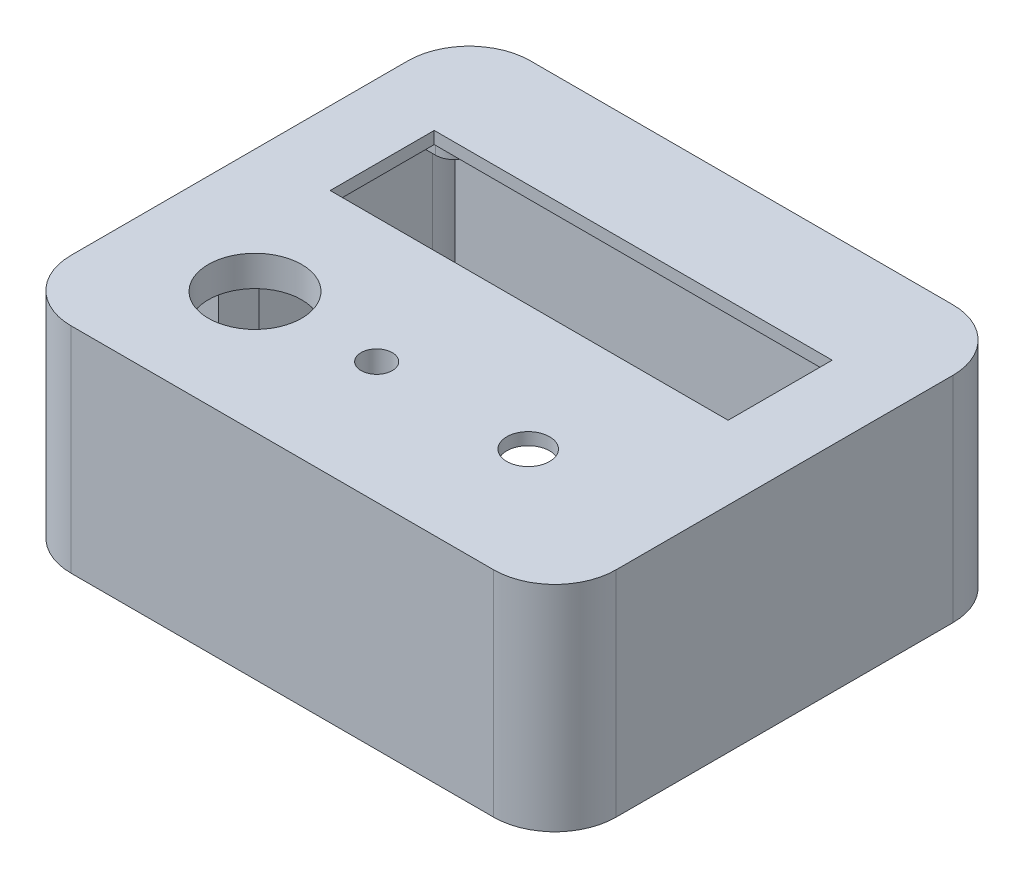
ISO-10303-21;
HEADER;
FILE_DESCRIPTION(('STEP AP214'),'2;1');
FILE_NAME('part.step','',(''),(''),'','','');
FILE_SCHEMA(('AUTOMOTIVE_DESIGN { 1 0 10303 214 1 1 1 1 }'));
ENDSEC;
DATA;
#1=APPLICATION_CONTEXT('core data for automotive mechanical design processes');
#2=APPLICATION_PROTOCOL_DEFINITION('international standard','automotive_design',2000,#1);
#3=PRODUCT_CONTEXT('',#1,'mechanical');
#4=PRODUCT('Part','Part','',(#3));
#5=PRODUCT_RELATED_PRODUCT_CATEGORY('part','',(#4));
#6=PRODUCT_DEFINITION_FORMATION('','',#4);
#7=PRODUCT_DEFINITION_CONTEXT('part definition',#1,'design');
#8=PRODUCT_DEFINITION('design','',#6,#7);
#9=PRODUCT_DEFINITION_SHAPE('','',#8);
#10=(LENGTH_UNIT() NAMED_UNIT(*) SI_UNIT(.MILLI.,.METRE.));
#11=(NAMED_UNIT(*) PLANE_ANGLE_UNIT() SI_UNIT($,.RADIAN.));
#12=(NAMED_UNIT(*) SI_UNIT($,.STERADIAN.) SOLID_ANGLE_UNIT());
#13=UNCERTAINTY_MEASURE_WITH_UNIT(LENGTH_MEASURE(1.E-05),#10,'distance_accuracy_value','');
#14=(GEOMETRIC_REPRESENTATION_CONTEXT(3) GLOBAL_UNCERTAINTY_ASSIGNED_CONTEXT((#13)) GLOBAL_UNIT_ASSIGNED_CONTEXT((#10,
#11,#12)) REPRESENTATION_CONTEXT('',''));
#15=CARTESIAN_POINT('',(0.,0.,0.));
#16=DIRECTION('',(0.,0.,1.));
#17=DIRECTION('',(1.,0.,0.));
#18=AXIS2_PLACEMENT_3D('',#15,#16,#17);
#19=CARTESIAN_POINT('',(0.,0.,0.));
#20=DIRECTION('',(0.,1.,0.));
#21=DIRECTION('',(0.,0.,1.));
#22=AXIS2_PLACEMENT_3D('',#19,#20,#21);
#23=PLANE('',#22);
#24=CARTESIAN_POINT('',(-24.3749999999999,0.,28.90390523));
#25=DIRECTION('',(0.,1.,0.));
#26=DIRECTION('',(0.,0.,1.));
#27=AXIS2_PLACEMENT_3D('',#24,#25,#26);
#28=CIRCLE('',#27,10.125);
#29=CARTESIAN_POINT('',(-24.3749999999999,0.,39.02890523));
#30=VERTEX_POINT('',#29);
#31=EDGE_CURVE('E50',#30,#30,#28,.F.);
#32=ORIENTED_EDGE('',*,*,#31,.F.);
#33=EDGE_LOOP('',(#32));
#34=FACE_BOUND('',#33,.T.);
#35=DIRECTION('',(0.,0.,-1.));
#36=VECTOR('',#35,1.);
#37=CARTESIAN_POINT('',(32.5,0.,8.5));
#38=LINE('',#37,#36);
#39=CARTESIAN_POINT('',(32.5,0.,8.5));
#40=VERTEX_POINT('',#39);
#41=CARTESIAN_POINT('',(32.5,0.,-8.5));
#42=VERTEX_POINT('',#41);
#43=EDGE_CURVE('E829',#40,#42,#38,.T.);
#44=ORIENTED_EDGE('',*,*,#43,.T.);
#45=DIRECTION('',(-1.,0.,0.));
#46=VECTOR('',#45,1.);
#47=CARTESIAN_POINT('',(-32.5,0.,-8.5));
#48=LINE('',#47,#46);
#49=CARTESIAN_POINT('',(-32.5,0.,-8.5));
#50=VERTEX_POINT('',#49);
#51=EDGE_CURVE('E848',#42,#50,#48,.T.);
#52=ORIENTED_EDGE('',*,*,#51,.T.);
#53=DIRECTION('',(0.,0.,1.));
#54=VECTOR('',#53,1.);
#55=CARTESIAN_POINT('',(-32.5,0.,8.5));
#56=LINE('',#55,#54);
#57=CARTESIAN_POINT('',(-32.5,0.,8.5));
#58=VERTEX_POINT('',#57);
#59=EDGE_CURVE('E852',#50,#58,#56,.T.);
#60=ORIENTED_EDGE('',*,*,#59,.T.);
#61=DIRECTION('',(1.,0.,0.));
#62=VECTOR('',#61,1.);
#63=CARTESIAN_POINT('',(-32.5,0.,8.5));
#64=LINE('',#63,#62);
#65=EDGE_CURVE('E834',#58,#40,#64,.T.);
#66=ORIENTED_EDGE('',*,*,#65,.T.);
#67=EDGE_LOOP('',(#44,#52,#60,#66));
#68=FACE_BOUND('',#67,.T.);
#69=CARTESIAN_POINT('',(20.25,0.,28.90390523));
#70=DIRECTION('',(0.,-1.,0.));
#71=DIRECTION('',(0.,0.,-1.));
#72=AXIS2_PLACEMENT_3D('',#69,#70,#71);
#73=CIRCLE('',#72,3.5);
#74=CARTESIAN_POINT('',(20.25,0.,25.40390523));
#75=VERTEX_POINT('',#74);
#76=EDGE_CURVE('E558',#75,#75,#73,.T.);
#77=ORIENTED_EDGE('',*,*,#76,.F.);
#78=EDGE_LOOP('',(#77));
#79=FACE_BOUND('',#78,.T.);
#80=CARTESIAN_POINT('',(38.3999999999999,0.,15.2));
#81=DIRECTION('',(0.,-1.,0.));
#82=DIRECTION('',(0.,0.,-1.));
#83=AXIS2_PLACEMENT_3D('',#80,#81,#82);
#84=CIRCLE('',#83,3.);
#85=CARTESIAN_POINT('',(35.3999999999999,0.,15.2));
#86=VERTEX_POINT('',#85);
#87=CARTESIAN_POINT('',(38.3999999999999,0.,12.2));
#88=VERTEX_POINT('',#87);
#89=EDGE_CURVE('E588',#86,#88,#84,.T.);
#90=ORIENTED_EDGE('',*,*,#89,.F.);
#91=DIRECTION('',(0.,0.,-1.));
#92=VECTOR('',#91,1.);
#93=CARTESIAN_POINT('',(35.3999999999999,0.,18.2));
#94=LINE('',#93,#92);
#95=CARTESIAN_POINT('',(35.3999999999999,0.,24.8));
#96=VERTEX_POINT('',#95);
#97=EDGE_CURVE('E1276',#96,#86,#94,.T.);
#98=ORIENTED_EDGE('',*,*,#97,.F.);
#99=DIRECTION('',(-1.,0.,0.));
#100=VECTOR('',#99,1.);
#101=CARTESIAN_POINT('',(41.,0.,24.8));
#102=LINE('',#101,#100);
#103=CARTESIAN_POINT('',(41.,0.,24.8));
#104=VERTEX_POINT('',#103);
#105=EDGE_CURVE('E1271',#104,#96,#102,.T.);
#106=ORIENTED_EDGE('',*,*,#105,.F.);
#107=DIRECTION('',(0.,0.,-1.));
#108=VECTOR('',#107,1.);
#109=CARTESIAN_POINT('',(41.,0.,18.2));
#110=LINE('',#109,#108);
#111=CARTESIAN_POINT('',(41.,0.,39.3));
#112=VERTEX_POINT('',#111);
#113=EDGE_CURVE('E488',#112,#104,#110,.T.);
#114=ORIENTED_EDGE('',*,*,#113,.F.);
#115=CARTESIAN_POINT('',(35.,0.,39.3));
#116=DIRECTION('',(0.,-1.,0.));
#117=DIRECTION('',(0.,0.,-1.));
#118=AXIS2_PLACEMENT_3D('',#115,#116,#117);
#119=CIRCLE('',#118,6.);
#120=CARTESIAN_POINT('',(40.2526183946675,0.,42.2));
#121=VERTEX_POINT('',#120);
#122=EDGE_CURVE('E439',#112,#121,#119,.T.);
#123=ORIENTED_EDGE('',*,*,#122,.T.);
#124=DIRECTION('',(1.,0.,0.));
#125=VECTOR('',#124,1.);
#126=CARTESIAN_POINT('',(0.,0.,42.2));
#127=LINE('',#126,#125);
#128=CARTESIAN_POINT('',(-40.2526183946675,0.,42.2));
#129=VERTEX_POINT('',#128);
#130=EDGE_CURVE('E443',#129,#121,#127,.T.);
#131=ORIENTED_EDGE('',*,*,#130,.F.);
#132=CARTESIAN_POINT('',(-34.9999999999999,0.,39.3));
#133=DIRECTION('',(0.,-1.,0.));
#134=DIRECTION('',(0.,0.,-1.));
#135=AXIS2_PLACEMENT_3D('',#132,#133,#134);
#136=CIRCLE('',#135,6.);
#137=CARTESIAN_POINT('',(-40.9999999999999,0.,39.3));
#138=VERTEX_POINT('',#137);
#139=EDGE_CURVE('E447',#129,#138,#136,.T.);
#140=ORIENTED_EDGE('',*,*,#139,.T.);
#141=DIRECTION('',(0.,0.,1.));
#142=VECTOR('',#141,1.);
#143=CARTESIAN_POINT('',(-40.9999999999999,0.,39.3));
#144=LINE('',#143,#142);
#145=CARTESIAN_POINT('',(-40.9999999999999,0.,24.8));
#146=VERTEX_POINT('',#145);
#147=EDGE_CURVE('E481',#146,#138,#144,.T.);
#148=ORIENTED_EDGE('',*,*,#147,.F.);
#149=DIRECTION('',(-1.,0.,0.));
#150=VECTOR('',#149,1.);
#151=CARTESIAN_POINT('',(-40.9999999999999,0.,24.8));
#152=LINE('',#151,#150);
#153=CARTESIAN_POINT('',(-34.4,0.,24.8));
#154=VERTEX_POINT('',#153);
#155=EDGE_CURVE('E392',#154,#146,#152,.T.);
#156=ORIENTED_EDGE('',*,*,#155,.F.);
#157=DIRECTION('',(0.,0.,1.));
#158=VECTOR('',#157,1.);
#159=CARTESIAN_POINT('',(-34.4,0.,18.2));
#160=LINE('',#159,#158);
#161=CARTESIAN_POINT('',(-34.4,0.,15.2));
#162=VERTEX_POINT('',#161);
#163=EDGE_CURVE('E387',#162,#154,#160,.T.);
#164=ORIENTED_EDGE('',*,*,#163,.F.);
#165=CARTESIAN_POINT('',(-37.4,0.,15.2));
#166=DIRECTION('',(0.,-1.,0.));
#167=DIRECTION('',(0.,0.,-1.));
#168=AXIS2_PLACEMENT_3D('',#165,#166,#167);
#169=CIRCLE('',#168,2.99999999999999);
#170=CARTESIAN_POINT('',(-37.4,0.,12.2));
#171=VERTEX_POINT('',#170);
#172=EDGE_CURVE('E619',#171,#162,#169,.T.);
#173=ORIENTED_EDGE('',*,*,#172,.F.);
#174=DIRECTION('',(-1.,0.,0.));
#175=VECTOR('',#174,1.);
#176=CARTESIAN_POINT('',(0.,0.,12.2));
#177=LINE('',#176,#175);
#178=CARTESIAN_POINT('',(-40.9999999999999,0.,12.2));
#179=VERTEX_POINT('',#178);
#180=EDGE_CURVE('E597',#171,#179,#177,.T.);
#181=ORIENTED_EDGE('',*,*,#180,.T.);
#182=DIRECTION('',(0.,0.,1.));
#183=VECTOR('',#182,1.);
#184=CARTESIAN_POINT('',(-40.9999999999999,0.,-13.6));
#185=LINE('',#184,#183);
#186=CARTESIAN_POINT('',(-40.9999999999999,0.,-13.6));
#187=VERTEX_POINT('',#186);
#188=EDGE_CURVE('E506',#187,#179,#185,.T.);
#189=ORIENTED_EDGE('',*,*,#188,.F.);
#190=DIRECTION('',(-1.,0.,0.));
#191=VECTOR('',#190,1.);
#192=CARTESIAN_POINT('',(0.,0.,-13.6000000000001));
#193=LINE('',#192,#191);
#194=CARTESIAN_POINT('',(-37.4,0.,-13.6));
#195=VERTEX_POINT('',#194);
#196=EDGE_CURVE('E635',#195,#187,#193,.T.);
#197=ORIENTED_EDGE('',*,*,#196,.F.);
#198=CARTESIAN_POINT('',(-37.4,0.,-16.6));
#199=DIRECTION('',(0.,-1.,0.));
#200=DIRECTION('',(0.,0.,-1.));
#201=AXIS2_PLACEMENT_3D('',#198,#199,#200);
#202=CIRCLE('',#201,2.99999999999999);
#203=CARTESIAN_POINT('',(-37.4,0.,-19.6));
#204=VERTEX_POINT('',#203);
#205=EDGE_CURVE('E629',#204,#195,#202,.T.);
#206=ORIENTED_EDGE('',*,*,#205,.F.);
#207=DIRECTION('',(1.,0.,0.));
#208=VECTOR('',#207,1.);
#209=CARTESIAN_POINT('',(0.,0.,-19.6));
#210=LINE('',#209,#208);
#211=CARTESIAN_POINT('',(38.3999999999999,0.,-19.6));
#212=VERTEX_POINT('',#211);
#213=EDGE_CURVE('E543',#204,#212,#210,.T.);
#214=ORIENTED_EDGE('',*,*,#213,.T.);
#215=CARTESIAN_POINT('',(38.3999999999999,0.,-16.6));
#216=DIRECTION('',(0.,-1.,0.));
#217=DIRECTION('',(0.,0.,-1.));
#218=AXIS2_PLACEMENT_3D('',#215,#216,#217);
#219=CIRCLE('',#218,3.);
#220=CARTESIAN_POINT('',(38.3999999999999,0.,-13.6));
#221=VERTEX_POINT('',#220);
#222=EDGE_CURVE('E658',#221,#212,#219,.T.);
#223=ORIENTED_EDGE('',*,*,#222,.F.);
#224=DIRECTION('',(1.,0.,0.));
#225=VECTOR('',#224,1.);
#226=CARTESIAN_POINT('',(0.,0.,-13.6));
#227=LINE('',#226,#225);
#228=CARTESIAN_POINT('',(41.,0.,-13.6));
#229=VERTEX_POINT('',#228);
#230=EDGE_CURVE('E664',#221,#229,#227,.T.);
#231=ORIENTED_EDGE('',*,*,#230,.T.);
#232=DIRECTION('',(0.,0.,-1.));
#233=VECTOR('',#232,1.);
#234=CARTESIAN_POINT('',(41.,0.,-13.6));
#235=LINE('',#234,#233);
#236=CARTESIAN_POINT('',(41.,0.,12.2));
#237=VERTEX_POINT('',#236);
#238=EDGE_CURVE('E525',#237,#229,#235,.T.);
#239=ORIENTED_EDGE('',*,*,#238,.F.);
#240=DIRECTION('',(1.,0.,0.));
#241=VECTOR('',#240,1.);
#242=CARTESIAN_POINT('',(0.,0.,12.1999999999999));
#243=LINE('',#242,#241);
#244=EDGE_CURVE('E580',#88,#237,#243,.T.);
#245=ORIENTED_EDGE('',*,*,#244,.F.);
#246=EDGE_LOOP('',(#90,#98,#106,#114,#123,#131,#140,#148,#156,#164,#173,#181,#189,#197,#206,
#214,#223,#231,#239,#245));
#247=FACE_BOUND('',#246,.T.);
#248=CARTESIAN_POINT('',(-4.49999999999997,0.,28.90390523));
#249=DIRECTION('',(0.,1.,0.));
#250=DIRECTION('',(0.,0.,1.));
#251=AXIS2_PLACEMENT_3D('',#248,#249,#250);
#252=CIRCLE('',#251,4.55);
#253=CARTESIAN_POINT('',(-4.49999999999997,0.,33.45390523));
#254=VERTEX_POINT('',#253);
#255=EDGE_CURVE('E11',#254,#254,#252,.F.);
#256=ORIENTED_EDGE('',*,*,#255,.F.);
#257=EDGE_LOOP('',(#256));
#258=FACE_BOUND('',#257,.T.);
#259=ADVANCED_FACE('F41',(#34,#68,#79,#247,#258),#23,.F.);
#260=CARTESIAN_POINT('',(-37.4,-6.5,15.2));
#261=DIRECTION('',(0.,1.,0.));
#262=DIRECTION('',(0.,0.,1.));
#263=AXIS2_PLACEMENT_3D('',#260,#261,#262);
#264=CYLINDRICAL_SURFACE('',#263,2.99999999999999);
#265=DIRECTION('',(0.,1.,0.));
#266=VECTOR('',#265,1.);
#267=CARTESIAN_POINT('',(-34.4,-6.5,15.2));
#268=LINE('',#267,#266);
#269=CARTESIAN_POINT('',(-34.4,-6.5,15.2));
#270=VERTEX_POINT('',#269);
#271=EDGE_CURVE('E1267',#270,#162,#268,.T.);
#272=ORIENTED_EDGE('',*,*,#271,.F.);
#273=CARTESIAN_POINT('',(-37.4,-6.5,15.2));
#274=DIRECTION('',(0.,-1.,0.));
#275=DIRECTION('',(0.,0.,-1.));
#276=AXIS2_PLACEMENT_3D('',#273,#274,#275);
#277=CIRCLE('',#276,2.99999999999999);
#278=CARTESIAN_POINT('',(-37.4,-6.5,12.2));
#279=VERTEX_POINT('',#278);
#280=EDGE_CURVE('E602',#279,#270,#277,.T.);
#281=ORIENTED_EDGE('',*,*,#280,.F.);
#282=DIRECTION('',(0.,1.,0.));
#283=VECTOR('',#282,1.);
#284=CARTESIAN_POINT('',(-37.4,-6.5,12.2));
#285=LINE('',#284,#283);
#286=EDGE_CURVE('E615',#279,#171,#285,.T.);
#287=ORIENTED_EDGE('',*,*,#286,.T.);
#288=ORIENTED_EDGE('',*,*,#172,.T.);
#289=EDGE_LOOP('',(#272,#281,#287,#288));
#290=FACE_BOUND('',#289,.T.);
#291=ADVANCED_FACE('F897',(#290),#264,.T.);
#292=CARTESIAN_POINT('',(41.,-30.5,-13.6));
#293=DIRECTION('',(1.,0.,0.));
#294=DIRECTION('',(0.,0.,-1.));
#295=AXIS2_PLACEMENT_3D('',#292,#293,#294);
#296=PLANE('',#295);
#297=DIRECTION('',(0.,1.,0.));
#298=VECTOR('',#297,1.);
#299=CARTESIAN_POINT('',(41.,-30.5,24.8));
#300=LINE('',#299,#298);
#301=CARTESIAN_POINT('',(41.,-30.5,24.8));
#302=VERTEX_POINT('',#301);
#303=EDGE_CURVE('E380',#302,#104,#300,.T.);
#304=ORIENTED_EDGE('',*,*,#303,.F.);
#305=DIRECTION('',(0.,0.,-1.));
#306=VECTOR('',#305,1.);
#307=CARTESIAN_POINT('',(41.,-30.5,-13.6));
#308=LINE('',#307,#306);
#309=CARTESIAN_POINT('',(41.,-30.5,39.3));
#310=VERTEX_POINT('',#309);
#311=EDGE_CURVE('E530',#310,#302,#308,.T.);
#312=ORIENTED_EDGE('',*,*,#311,.F.);
#313=DIRECTION('',(0.,1.,0.));
#314=VECTOR('',#313,1.);
#315=CARTESIAN_POINT('',(41.,-30.5,39.3));
#316=LINE('',#315,#314);
#317=EDGE_CURVE('E492',#310,#112,#316,.T.);
#318=ORIENTED_EDGE('',*,*,#317,.T.);
#319=ORIENTED_EDGE('',*,*,#113,.T.);
#320=EDGE_LOOP('',(#304,#312,#318,#319));
#321=FACE_BOUND('',#320,.T.);
#322=ADVANCED_FACE('F989',(#321),#296,.F.);
#323=DIRECTION('',(0.,1.,0.));
#324=VECTOR('',#323,1.);
#325=CARTESIAN_POINT('',(41.,-30.5,18.2));
#326=LINE('',#325,#324);
#327=CARTESIAN_POINT('',(41.,-30.5,18.2));
#328=VERTEX_POINT('',#327);
#329=CARTESIAN_POINT('',(41.,-6.50000000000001,18.2));
#330=VERTEX_POINT('',#329);
#331=EDGE_CURVE('E57',#328,#330,#326,.T.);
#332=ORIENTED_EDGE('',*,*,#331,.T.);
#333=DIRECTION('',(0.,0.,-1.));
#334=VECTOR('',#333,1.);
#335=CARTESIAN_POINT('',(41.,-6.5,0.));
#336=LINE('',#335,#334);
#337=CARTESIAN_POINT('',(41.,-6.50000000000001,12.2));
#338=VERTEX_POINT('',#337);
#339=EDGE_CURVE('E355',#330,#338,#336,.T.);
#340=ORIENTED_EDGE('',*,*,#339,.T.);
#341=DIRECTION('',(0.,1.,0.));
#342=VECTOR('',#341,1.);
#343=CARTESIAN_POINT('',(41.,-30.5,12.2));
#344=LINE('',#343,#342);
#345=EDGE_CURVE('E540',#338,#237,#344,.T.);
#346=ORIENTED_EDGE('',*,*,#345,.T.);
#347=ORIENTED_EDGE('',*,*,#238,.T.);
#348=DIRECTION('',(0.,1.,0.));
#349=VECTOR('',#348,1.);
#350=CARTESIAN_POINT('',(41.,-30.5,-13.6));
#351=LINE('',#350,#349);
#352=CARTESIAN_POINT('',(41.,-6.50000000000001,-13.6));
#353=VERTEX_POINT('',#352);
#354=EDGE_CURVE('E534',#353,#229,#351,.T.);
#355=ORIENTED_EDGE('',*,*,#354,.F.);
#356=DIRECTION('',(0.,0.,-1.));
#357=VECTOR('',#356,1.);
#358=CARTESIAN_POINT('',(41.,-6.5,0.));
#359=LINE('',#358,#357);
#360=CARTESIAN_POINT('',(41.,-6.5,-16.7));
#361=VERTEX_POINT('',#360);
#362=EDGE_CURVE('E469',#353,#361,#359,.T.);
#363=ORIENTED_EDGE('',*,*,#362,.T.);
#364=DIRECTION('',(0.,-1.,0.));
#365=VECTOR('',#364,1.);
#366=CARTESIAN_POINT('',(41.,0.,-16.7));
#367=LINE('',#366,#365);
#368=CARTESIAN_POINT('',(41.,-30.5,-16.7));
#369=VERTEX_POINT('',#368);
#370=EDGE_CURVE('E872',#361,#369,#367,.T.);
#371=ORIENTED_EDGE('',*,*,#370,.T.);
#372=EDGE_CURVE('E529',#328,#369,#308,.T.);
#373=ORIENTED_EDGE('',*,*,#372,.F.);
#374=EDGE_LOOP('',(#332,#340,#346,#347,#355,#363,#371,#373));
#375=FACE_BOUND('',#374,.T.);
#376=ADVANCED_FACE('F987',(#375),#296,.F.);
#377=CARTESIAN_POINT('',(-40.9999999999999,-30.5,-13.6));
#378=DIRECTION('',(-1.,0.,0.));
#379=DIRECTION('',(0.,0.,1.));
#380=AXIS2_PLACEMENT_3D('',#377,#378,#379);
#381=PLANE('',#380);
#382=DIRECTION('',(0.,1.,0.));
#383=VECTOR('',#382,1.);
#384=CARTESIAN_POINT('',(-40.9999999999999,-30.5,18.2));
#385=LINE('',#384,#383);
#386=CARTESIAN_POINT('',(-40.9999999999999,-30.5,18.2));
#387=VERTEX_POINT('',#386);
#388=CARTESIAN_POINT('',(-40.9999999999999,-6.50000000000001,18.2));
#389=VERTEX_POINT('',#388);
#390=EDGE_CURVE('E412',#387,#389,#385,.T.);
#391=ORIENTED_EDGE('',*,*,#390,.F.);
#392=DIRECTION('',(0.,0.,1.));
#393=VECTOR('',#392,1.);
#394=CARTESIAN_POINT('',(-40.9999999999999,-30.5,-13.6));
#395=LINE('',#394,#393);
#396=CARTESIAN_POINT('',(-40.9999999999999,-30.5,-16.7));
#397=VERTEX_POINT('',#396);
#398=EDGE_CURVE('E512',#397,#387,#395,.T.);
#399=ORIENTED_EDGE('',*,*,#398,.F.);
#400=DIRECTION('',(0.,-1.,0.));
#401=VECTOR('',#400,1.);
#402=CARTESIAN_POINT('',(-40.9999999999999,0.,-16.7));
#403=LINE('',#402,#401);
#404=CARTESIAN_POINT('',(-40.9999999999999,-6.49999999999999,-16.7));
#405=VERTEX_POINT('',#404);
#406=EDGE_CURVE('E886',#405,#397,#403,.T.);
#407=ORIENTED_EDGE('',*,*,#406,.F.);
#408=DIRECTION('',(0.,0.,-1.));
#409=VECTOR('',#408,1.);
#410=CARTESIAN_POINT('',(-40.9999999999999,-6.5,0.));
#411=LINE('',#410,#409);
#412=CARTESIAN_POINT('',(-40.9999999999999,-6.5,-13.6));
#413=VERTEX_POINT('',#412);
#414=EDGE_CURVE('E473',#413,#405,#411,.T.);
#415=ORIENTED_EDGE('',*,*,#414,.F.);
#416=DIRECTION('',(0.,1.,0.));
#417=VECTOR('',#416,1.);
#418=CARTESIAN_POINT('',(-40.9999999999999,-30.5,-13.6));
#419=LINE('',#418,#417);
#420=EDGE_CURVE('E522',#413,#187,#419,.T.);
#421=ORIENTED_EDGE('',*,*,#420,.T.);
#422=ORIENTED_EDGE('',*,*,#188,.T.);
#423=DIRECTION('',(0.,1.,0.));
#424=VECTOR('',#423,1.);
#425=CARTESIAN_POINT('',(-40.9999999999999,-30.5,12.2));
#426=LINE('',#425,#424);
#427=CARTESIAN_POINT('',(-40.9999999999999,-6.50000000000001,12.2));
#428=VERTEX_POINT('',#427);
#429=EDGE_CURVE('E516',#428,#179,#426,.T.);
#430=ORIENTED_EDGE('',*,*,#429,.F.);
#431=DIRECTION('',(0.,0.,1.));
#432=VECTOR('',#431,1.);
#433=CARTESIAN_POINT('',(-40.9999999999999,-6.5,0.));
#434=LINE('',#433,#432);
#435=EDGE_CURVE('E477',#428,#389,#434,.T.);
#436=ORIENTED_EDGE('',*,*,#435,.T.);
#437=EDGE_LOOP('',(#391,#399,#407,#415,#421,#422,#430,#436));
#438=FACE_BOUND('',#437,.T.);
#439=ADVANCED_FACE('F983',(#438),#381,.F.);
#440=DIRECTION('',(0.,1.,0.));
#441=VECTOR('',#440,1.);
#442=CARTESIAN_POINT('',(-40.9999999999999,-30.5,24.8));
#443=LINE('',#442,#441);
#444=CARTESIAN_POINT('',(-40.9999999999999,-30.5,24.8));
#445=VERTEX_POINT('',#444);
#446=EDGE_CURVE('E65',#445,#146,#443,.T.);
#447=ORIENTED_EDGE('',*,*,#446,.T.);
#448=ORIENTED_EDGE('',*,*,#147,.T.);
#449=DIRECTION('',(0.,1.,0.));
#450=VECTOR('',#449,1.);
#451=CARTESIAN_POINT('',(-40.9999999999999,-30.5,39.3));
#452=LINE('',#451,#450);
#453=CARTESIAN_POINT('',(-40.9999999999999,-30.5,39.3));
#454=VERTEX_POINT('',#453);
#455=EDGE_CURVE('E484',#454,#138,#452,.T.);
#456=ORIENTED_EDGE('',*,*,#455,.F.);
#457=EDGE_CURVE('E511',#445,#454,#395,.T.);
#458=ORIENTED_EDGE('',*,*,#457,.F.);
#459=EDGE_LOOP('',(#447,#448,#456,#458));
#460=FACE_BOUND('',#459,.T.);
#461=ADVANCED_FACE('F986',(#460),#381,.F.);
#462=CARTESIAN_POINT('',(0.,-30.5,-19.6));
#463=DIRECTION('',(0.,0.,1.));
#464=DIRECTION('',(1.,0.,0.));
#465=AXIS2_PLACEMENT_3D('',#462,#463,#464);
#466=PLANE('',#465);
#467=DIRECTION('',(-1.,0.,0.));
#468=VECTOR('',#467,1.);
#469=CARTESIAN_POINT('',(0.,-6.5,-19.5999999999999));
#470=LINE('',#469,#468);
#471=CARTESIAN_POINT('',(-37.4,-6.5,-19.6));
#472=VERTEX_POINT('',#471);
#473=CARTESIAN_POINT('',(-40.2139735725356,-6.5,-19.6));
#474=VERTEX_POINT('',#473);
#475=EDGE_CURVE('E630',#472,#474,#470,.T.);
#476=ORIENTED_EDGE('',*,*,#475,.T.);
#477=DIRECTION('',(0.,-1.,0.));
#478=VECTOR('',#477,1.);
#479=CARTESIAN_POINT('',(-40.2139735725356,0.,-19.6));
#480=LINE('',#479,#478);
#481=CARTESIAN_POINT('',(-40.2139735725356,-30.5,-19.6));
#482=VERTEX_POINT('',#481);
#483=EDGE_CURVE('E418',#474,#482,#480,.T.);
#484=ORIENTED_EDGE('',*,*,#483,.T.);
#485=DIRECTION('',(1.,0.,0.));
#486=VECTOR('',#485,1.);
#487=CARTESIAN_POINT('',(0.,-30.5,-19.6));
#488=LINE('',#487,#486);
#489=CARTESIAN_POINT('',(40.2526183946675,-30.5,-19.6));
#490=VERTEX_POINT('',#489);
#491=EDGE_CURVE('E544',#482,#490,#488,.T.);
#492=ORIENTED_EDGE('',*,*,#491,.T.);
#493=DIRECTION('',(0.,-1.,0.));
#494=VECTOR('',#493,1.);
#495=CARTESIAN_POINT('',(40.2526183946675,0.,-19.6));
#496=LINE('',#495,#494);
#497=CARTESIAN_POINT('',(40.2526183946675,-6.5,-19.6));
#498=VERTEX_POINT('',#497);
#499=EDGE_CURVE('E430',#498,#490,#496,.T.);
#500=ORIENTED_EDGE('',*,*,#499,.F.);
#501=DIRECTION('',(1.,0.,0.));
#502=VECTOR('',#501,1.);
#503=CARTESIAN_POINT('',(0.,-6.5,-19.6));
#504=LINE('',#503,#502);
#505=CARTESIAN_POINT('',(38.3999999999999,-6.5,-19.6));
#506=VERTEX_POINT('',#505);
#507=EDGE_CURVE('E667',#506,#498,#504,.T.);
#508=ORIENTED_EDGE('',*,*,#507,.F.);
#509=DIRECTION('',(0.,1.,0.));
#510=VECTOR('',#509,1.);
#511=CARTESIAN_POINT('',(38.3999999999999,-6.5,-19.6));
#512=LINE('',#511,#510);
#513=EDGE_CURVE('E685',#506,#212,#512,.T.);
#514=ORIENTED_EDGE('',*,*,#513,.T.);
#515=ORIENTED_EDGE('',*,*,#213,.F.);
#516=DIRECTION('',(0.,1.,0.));
#517=VECTOR('',#516,1.);
#518=CARTESIAN_POINT('',(-37.4,-6.5,-19.6));
#519=LINE('',#518,#517);
#520=EDGE_CURVE('E655',#472,#204,#519,.T.);
#521=ORIENTED_EDGE('',*,*,#520,.F.);
#522=EDGE_LOOP('',(#476,#484,#492,#500,#508,#514,#515,#521));
#523=FACE_BOUND('',#522,.T.);
#524=ADVANCED_FACE('F997',(#523),#466,.T.);
#525=CARTESIAN_POINT('',(0.,-6.5,0.));
#526=DIRECTION('',(0.,-1.,0.));
#527=DIRECTION('',(0.,0.,-1.));
#528=AXIS2_PLACEMENT_3D('',#525,#526,#527);
#529=PLANE('',#528);
#530=CARTESIAN_POINT('',(-37.4,-6.5,-16.6));
#531=DIRECTION('',(0.,-1.,0.));
#532=DIRECTION('',(0.,0.,-1.));
#533=AXIS2_PLACEMENT_3D('',#530,#531,#532);
#534=CIRCLE('',#533,1.6);
#535=CARTESIAN_POINT('',(-37.4,-6.5,-15.));
#536=VERTEX_POINT('',#535);
#537=EDGE_CURVE('E642',#536,#536,#534,.F.);
#538=ORIENTED_EDGE('',*,*,#537,.T.);
#539=EDGE_LOOP('',(#538));
#540=FACE_BOUND('',#539,.T.);
#541=ORIENTED_EDGE('',*,*,#414,.T.);
#542=CARTESIAN_POINT('',(-35.2572938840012,-6.5,-16.7));
#543=DIRECTION('',(0.,-1.,0.));
#544=DIRECTION('',(0.,0.,-1.));
#545=AXIS2_PLACEMENT_3D('',#542,#543,#544);
#546=CIRCLE('',#545,5.74270611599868);
#547=EDGE_CURVE('E422',#405,#474,#546,.T.);
#548=ORIENTED_EDGE('',*,*,#547,.T.);
#549=ORIENTED_EDGE('',*,*,#475,.F.);
#550=CARTESIAN_POINT('',(-37.4,-6.5,-16.6));
#551=DIRECTION('',(0.,-1.,0.));
#552=DIRECTION('',(0.,0.,-1.));
#553=AXIS2_PLACEMENT_3D('',#550,#551,#552);
#554=CIRCLE('',#553,2.99999999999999);
#555=CARTESIAN_POINT('',(-37.4,-6.5,-13.6));
#556=VERTEX_POINT('',#555);
#557=EDGE_CURVE('E634',#472,#556,#554,.T.);
#558=ORIENTED_EDGE('',*,*,#557,.T.);
#559=DIRECTION('',(-1.,0.,0.));
#560=VECTOR('',#559,1.);
#561=CARTESIAN_POINT('',(0.,-6.5,-13.6000000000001));
#562=LINE('',#561,#560);
#563=EDGE_CURVE('E638',#556,#413,#562,.T.);
#564=ORIENTED_EDGE('',*,*,#563,.T.);
#565=EDGE_LOOP('',(#541,#548,#549,#558,#564));
#566=FACE_BOUND('',#565,.T.);
#567=ADVANCED_FACE('F1000',(#540,#566),#529,.T.);
#568=CARTESIAN_POINT('',(0.,-6.5,0.));
#569=DIRECTION('',(0.,-1.,0.));
#570=DIRECTION('',(0.,0.,-1.));
#571=AXIS2_PLACEMENT_3D('',#568,#569,#570);
#572=PLANE('',#571);
#573=CARTESIAN_POINT('',(38.3999999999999,-6.5,-16.6));
#574=DIRECTION('',(0.,-1.,0.));
#575=DIRECTION('',(0.,0.,-1.));
#576=AXIS2_PLACEMENT_3D('',#573,#574,#575);
#577=CIRCLE('',#576,1.6);
#578=CARTESIAN_POINT('',(38.3999999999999,-6.5,-15.));
#579=VERTEX_POINT('',#578);
#580=EDGE_CURVE('E659',#579,#579,#577,.F.);
#581=ORIENTED_EDGE('',*,*,#580,.T.);
#582=EDGE_LOOP('',(#581));
#583=FACE_BOUND('',#582,.T.);
#584=ORIENTED_EDGE('',*,*,#507,.T.);
#585=CARTESIAN_POINT('',(35.,-6.5,-16.7));
#586=DIRECTION('',(0.,-1.,0.));
#587=DIRECTION('',(0.,0.,-1.));
#588=AXIS2_PLACEMENT_3D('',#585,#586,#587);
#589=CIRCLE('',#588,6.);
#590=EDGE_CURVE('E434',#498,#361,#589,.T.);
#591=ORIENTED_EDGE('',*,*,#590,.T.);
#592=ORIENTED_EDGE('',*,*,#362,.F.);
#593=DIRECTION('',(1.,0.,0.));
#594=VECTOR('',#593,1.);
#595=CARTESIAN_POINT('',(0.,-6.5,-13.6));
#596=LINE('',#595,#594);
#597=CARTESIAN_POINT('',(38.3999999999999,-6.5,-13.6));
#598=VERTEX_POINT('',#597);
#599=EDGE_CURVE('E671',#598,#353,#596,.T.);
#600=ORIENTED_EDGE('',*,*,#599,.F.);
#601=CARTESIAN_POINT('',(38.3999999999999,-6.5,-16.6));
#602=DIRECTION('',(0.,-1.,0.));
#603=DIRECTION('',(0.,0.,-1.));
#604=AXIS2_PLACEMENT_3D('',#601,#602,#603);
#605=CIRCLE('',#604,3.);
#606=EDGE_CURVE('E663',#598,#506,#605,.T.);
#607=ORIENTED_EDGE('',*,*,#606,.T.);
#608=EDGE_LOOP('',(#584,#591,#592,#600,#607));
#609=FACE_BOUND('',#608,.T.);
#610=ADVANCED_FACE('F1056',(#583,#609),#572,.T.);
#611=CARTESIAN_POINT('',(42.,-33.,0.));
#612=DIRECTION('',(-1.,0.,0.));
#613=DIRECTION('',(0.,0.,1.));
#614=AXIS2_PLACEMENT_3D('',#611,#612,#613);
#615=PLANE('',#614);
#616=DIRECTION('',(0.,1.,0.));
#617=VECTOR('',#616,1.);
#618=CARTESIAN_POINT('',(42.,-33.,39.3));
#619=LINE('',#618,#617);
#620=CARTESIAN_POINT('',(42.,-33.,39.3));
#621=VERTEX_POINT('',#620);
#622=CARTESIAN_POINT('',(42.,-30.5,39.3));
#623=VERTEX_POINT('',#622);
#624=EDGE_CURVE('E754',#621,#623,#619,.T.);
#625=ORIENTED_EDGE('',*,*,#624,.T.);
#626=DIRECTION('',(0.,0.,1.));
#627=VECTOR('',#626,1.);
#628=CARTESIAN_POINT('',(42.,-30.5,-13.6));
#629=LINE('',#628,#627);
#630=CARTESIAN_POINT('',(42.,-30.5,-16.7));
#631=VERTEX_POINT('',#630);
#632=EDGE_CURVE('E526',#631,#623,#629,.T.);
#633=ORIENTED_EDGE('',*,*,#632,.F.);
#634=DIRECTION('',(0.,1.,0.));
#635=VECTOR('',#634,1.);
#636=CARTESIAN_POINT('',(42.,-33.,-16.7));
#637=LINE('',#636,#635);
#638=CARTESIAN_POINT('',(42.,-33.,-16.7));
#639=VERTEX_POINT('',#638);
#640=EDGE_CURVE('E751',#631,#639,#637,.F.);
#641=ORIENTED_EDGE('',*,*,#640,.T.);
#642=DIRECTION('',(0.,0.,1.));
#643=VECTOR('',#642,1.);
#644=CARTESIAN_POINT('',(42.,-33.,0.));
#645=LINE('',#644,#643);
#646=EDGE_CURVE('E711',#639,#621,#645,.T.);
#647=ORIENTED_EDGE('',*,*,#646,.T.);
#648=EDGE_LOOP('',(#625,#633,#641,#647));
#649=FACE_BOUND('',#648,.T.);
#650=ADVANCED_FACE('F1072',(#649),#615,.T.);
#651=CARTESIAN_POINT('',(-41.9999999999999,-33.,0.));
#652=DIRECTION('',(-1.,0.,0.));
#653=DIRECTION('',(0.,0.,1.));
#654=AXIS2_PLACEMENT_3D('',#651,#652,#653);
#655=PLANE('',#654);
#656=DIRECTION('',(0.,1.,0.));
#657=VECTOR('',#656,1.);
#658=CARTESIAN_POINT('',(-41.9999999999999,-33.,-16.7));
#659=LINE('',#658,#657);
#660=CARTESIAN_POINT('',(-41.9999999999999,-33.,-16.7));
#661=VERTEX_POINT('',#660);
#662=CARTESIAN_POINT('',(-41.9999999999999,-30.5,-16.7));
#663=VERTEX_POINT('',#662);
#664=EDGE_CURVE('E744',#661,#663,#659,.T.);
#665=ORIENTED_EDGE('',*,*,#664,.T.);
#666=DIRECTION('',(0.,0.,-1.));
#667=VECTOR('',#666,1.);
#668=CARTESIAN_POINT('',(-41.9999999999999,-30.5,-13.6));
#669=LINE('',#668,#667);
#670=CARTESIAN_POINT('',(-41.9999999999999,-30.5,39.3));
#671=VERTEX_POINT('',#670);
#672=EDGE_CURVE('E507',#671,#663,#669,.T.);
#673=ORIENTED_EDGE('',*,*,#672,.F.);
#674=DIRECTION('',(0.,1.,0.));
#675=VECTOR('',#674,1.);
#676=CARTESIAN_POINT('',(-41.9999999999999,-33.,39.3));
#677=LINE('',#676,#675);
#678=CARTESIAN_POINT('',(-41.9999999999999,-33.,39.3));
#679=VERTEX_POINT('',#678);
#680=EDGE_CURVE('E748',#671,#679,#677,.F.);
#681=ORIENTED_EDGE('',*,*,#680,.T.);
#682=DIRECTION('',(0.,0.,1.));
#683=VECTOR('',#682,1.);
#684=CARTESIAN_POINT('',(-41.9999999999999,-33.,0.));
#685=LINE('',#684,#683);
#686=EDGE_CURVE('E719',#661,#679,#685,.T.);
#687=ORIENTED_EDGE('',*,*,#686,.F.);
#688=EDGE_LOOP('',(#665,#673,#681,#687));
#689=FACE_BOUND('',#688,.T.);
#690=ADVANCED_FACE('F1065',(#689),#655,.F.);
#691=CARTESIAN_POINT('',(0.,-6.5,-13.6000000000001));
#692=DIRECTION('',(0.,0.,-1.));
#693=DIRECTION('',(-1.,0.,0.));
#694=AXIS2_PLACEMENT_3D('',#691,#692,#693);
#695=PLANE('',#694);
#696=ORIENTED_EDGE('',*,*,#420,.F.);
#697=ORIENTED_EDGE('',*,*,#563,.F.);
#698=DIRECTION('',(0.,1.,0.));
#699=VECTOR('',#698,1.);
#700=CARTESIAN_POINT('',(-37.4,-6.5,-13.6));
#701=LINE('',#700,#699);
#702=EDGE_CURVE('E646',#556,#195,#701,.T.);
#703=ORIENTED_EDGE('',*,*,#702,.T.);
#704=ORIENTED_EDGE('',*,*,#196,.T.);
#705=EDGE_LOOP('',(#696,#697,#703,#704));
#706=FACE_BOUND('',#705,.T.);
#707=ADVANCED_FACE('F1052',(#706),#695,.F.);
#708=CARTESIAN_POINT('',(0.,-6.5,12.2));
#709=DIRECTION('',(0.,0.,-1.));
#710=DIRECTION('',(-1.,0.,0.));
#711=AXIS2_PLACEMENT_3D('',#708,#709,#710);
#712=PLANE('',#711);
#713=DIRECTION('',(-1.,0.,0.));
#714=VECTOR('',#713,1.);
#715=CARTESIAN_POINT('',(0.,-6.5,12.2));
#716=LINE('',#715,#714);
#717=EDGE_CURVE('E598',#279,#428,#716,.T.);
#718=ORIENTED_EDGE('',*,*,#717,.T.);
#719=ORIENTED_EDGE('',*,*,#429,.T.);
#720=ORIENTED_EDGE('',*,*,#180,.F.);
#721=ORIENTED_EDGE('',*,*,#286,.F.);
#722=EDGE_LOOP('',(#718,#719,#720,#721));
#723=FACE_BOUND('',#722,.T.);
#724=ADVANCED_FACE('F1049',(#723),#712,.T.);
#725=CARTESIAN_POINT('',(0.,-6.5,-13.6));
#726=DIRECTION('',(0.,0.,1.));
#727=DIRECTION('',(1.,0.,0.));
#728=AXIS2_PLACEMENT_3D('',#725,#726,#727);
#729=PLANE('',#728);
#730=ORIENTED_EDGE('',*,*,#599,.T.);
#731=ORIENTED_EDGE('',*,*,#354,.T.);
#732=ORIENTED_EDGE('',*,*,#230,.F.);
#733=DIRECTION('',(0.,1.,0.));
#734=VECTOR('',#733,1.);
#735=CARTESIAN_POINT('',(38.3999999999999,-6.5,-13.6));
#736=LINE('',#735,#734);
#737=EDGE_CURVE('E675',#598,#221,#736,.T.);
#738=ORIENTED_EDGE('',*,*,#737,.F.);
#739=EDGE_LOOP('',(#730,#731,#732,#738));
#740=FACE_BOUND('',#739,.T.);
#741=ADVANCED_FACE('F1028',(#740),#729,.T.);
#742=CARTESIAN_POINT('',(0.,-6.5,12.1999999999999));
#743=DIRECTION('',(0.,0.,1.));
#744=DIRECTION('',(1.,0.,0.));
#745=AXIS2_PLACEMENT_3D('',#742,#743,#744);
#746=PLANE('',#745);
#747=ORIENTED_EDGE('',*,*,#345,.F.);
#748=DIRECTION('',(1.,0.,0.));
#749=VECTOR('',#748,1.);
#750=CARTESIAN_POINT('',(0.,-6.5,12.1999999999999));
#751=LINE('',#750,#749);
#752=CARTESIAN_POINT('',(38.3999999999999,-6.5,12.2));
#753=VERTEX_POINT('',#752);
#754=EDGE_CURVE('E359',#753,#338,#751,.T.);
#755=ORIENTED_EDGE('',*,*,#754,.F.);
#756=DIRECTION('',(0.,1.,0.));
#757=VECTOR('',#756,1.);
#758=CARTESIAN_POINT('',(38.3999999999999,-6.5,12.2));
#759=LINE('',#758,#757);
#760=EDGE_CURVE('E358',#753,#88,#759,.T.);
#761=ORIENTED_EDGE('',*,*,#760,.T.);
#762=ORIENTED_EDGE('',*,*,#244,.T.);
#763=EDGE_LOOP('',(#747,#755,#761,#762));
#764=FACE_BOUND('',#763,.T.);
#765=ADVANCED_FACE('F1024',(#764),#746,.F.);
#766=CARTESIAN_POINT('',(35.,-33.,-16.7));
#767=DIRECTION('',(0.,-1.,0.));
#768=DIRECTION('',(0.,0.,-1.));
#769=AXIS2_PLACEMENT_3D('',#766,#767,#768);
#770=CYLINDRICAL_SURFACE('',#769,7.);
#771=ORIENTED_EDGE('',*,*,#640,.F.);
#772=CARTESIAN_POINT('',(35.,-30.5,-16.7));
#773=DIRECTION('',(0.,-1.,0.));
#774=DIRECTION('',(0.,0.,-1.));
#775=AXIS2_PLACEMENT_3D('',#772,#773,#774);
#776=CIRCLE('',#775,7.);
#777=CARTESIAN_POINT('',(35.,-30.5,-23.7));
#778=VERTEX_POINT('',#777);
#779=EDGE_CURVE('E555',#778,#631,#776,.T.);
#780=ORIENTED_EDGE('',*,*,#779,.F.);
#781=DIRECTION('',(0.,1.,0.));
#782=VECTOR('',#781,1.);
#783=CARTESIAN_POINT('',(35.,2.,-23.7));
#784=LINE('',#783,#782);
#785=CARTESIAN_POINT('',(35.,-33.,-23.7));
#786=VERTEX_POINT('',#785);
#787=EDGE_CURVE('E761',#786,#778,#784,.T.);
#788=ORIENTED_EDGE('',*,*,#787,.F.);
#789=CARTESIAN_POINT('',(35.,-33.,-16.7));
#790=DIRECTION('',(0.,1.,0.));
#791=DIRECTION('',(0.,0.,1.));
#792=AXIS2_PLACEMENT_3D('',#789,#790,#791);
#793=CIRCLE('',#792,7.);
#794=EDGE_CURVE('E771',#639,#786,#793,.T.);
#795=ORIENTED_EDGE('',*,*,#794,.F.);
#796=EDGE_LOOP('',(#771,#780,#788,#795));
#797=FACE_BOUND('',#796,.T.);
#798=ADVANCED_FACE('F1027',(#797),#770,.F.);
#799=CARTESIAN_POINT('',(0.,2.,0.));
#800=DIRECTION('',(0.,1.,0.));
#801=DIRECTION('',(0.,0.,1.));
#802=AXIS2_PLACEMENT_3D('',#799,#800,#801);
#803=PLANE('',#802);
#804=CARTESIAN_POINT('',(-24.3749999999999,2.,28.90390523));
#805=DIRECTION('',(0.,1.,0.));
#806=DIRECTION('',(0.,0.,1.));
#807=AXIS2_PLACEMENT_3D('',#804,#805,#806);
#808=CIRCLE('',#807,7.625);
#809=CARTESIAN_POINT('',(-24.3749999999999,2.,21.27890523));
#810=VERTEX_POINT('',#809);
#811=EDGE_CURVE('E570',#810,#810,#808,.T.);
#812=ORIENTED_EDGE('',*,*,#811,.F.);
#813=EDGE_LOOP('',(#812));
#814=FACE_BOUND('',#813,.T.);
#815=CARTESIAN_POINT('',(20.25,2.,28.90390523));
#816=DIRECTION('',(0.,1.,0.));
#817=DIRECTION('',(0.,0.,1.));
#818=AXIS2_PLACEMENT_3D('',#815,#816,#817);
#819=CIRCLE('',#818,3.5);
#820=CARTESIAN_POINT('',(20.25,2.,25.40390523));
#821=VERTEX_POINT('',#820);
#822=EDGE_CURVE('E876',#821,#821,#819,.T.);
#823=ORIENTED_EDGE('',*,*,#822,.F.);
#824=EDGE_LOOP('',(#823));
#825=FACE_BOUND('',#824,.T.);
#826=CARTESIAN_POINT('',(-4.49999999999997,2.,28.90390523));
#827=DIRECTION('',(0.,1.,0.));
#828=DIRECTION('',(0.,0.,1.));
#829=AXIS2_PLACEMENT_3D('',#826,#827,#828);
#830=CIRCLE('',#829,2.55);
#831=CARTESIAN_POINT('',(-4.49999999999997,2.,26.35390523));
#832=VERTEX_POINT('',#831);
#833=EDGE_CURVE('E564',#832,#832,#830,.T.);
#834=ORIENTED_EDGE('',*,*,#833,.F.);
#835=EDGE_LOOP('',(#834));
#836=FACE_BOUND('',#835,.T.);
#837=DIRECTION('',(-1.,0.,0.));
#838=VECTOR('',#837,1.);
#839=CARTESIAN_POINT('',(-32.5,2.,-8.5));
#840=LINE('',#839,#838);
#841=CARTESIAN_POINT('',(32.5,2.,-8.5));
#842=VERTEX_POINT('',#841);
#843=CARTESIAN_POINT('',(-32.5,2.,-8.5));
#844=VERTEX_POINT('',#843);
#845=EDGE_CURVE('E833',#842,#844,#840,.T.);
#846=ORIENTED_EDGE('',*,*,#845,.F.);
#847=DIRECTION('',(0.,0.,-1.));
#848=VECTOR('',#847,1.);
#849=CARTESIAN_POINT('',(32.5,2.,8.5));
#850=LINE('',#849,#848);
#851=CARTESIAN_POINT('',(32.5,2.,8.5));
#852=VERTEX_POINT('',#851);
#853=EDGE_CURVE('E830',#852,#842,#850,.T.);
#854=ORIENTED_EDGE('',*,*,#853,.F.);
#855=DIRECTION('',(1.,0.,0.));
#856=VECTOR('',#855,1.);
#857=CARTESIAN_POINT('',(-32.5,2.,8.5));
#858=LINE('',#857,#856);
#859=CARTESIAN_POINT('',(-32.5,2.,8.5));
#860=VERTEX_POINT('',#859);
#861=EDGE_CURVE('E841',#860,#852,#858,.T.);
#862=ORIENTED_EDGE('',*,*,#861,.F.);
#863=DIRECTION('',(0.,0.,1.));
#864=VECTOR('',#863,1.);
#865=CARTESIAN_POINT('',(-32.5,2.,8.5));
#866=LINE('',#865,#864);
#867=EDGE_CURVE('E837',#844,#860,#866,.T.);
#868=ORIENTED_EDGE('',*,*,#867,.F.);
#869=EDGE_LOOP('',(#846,#854,#862,#868));
#870=FACE_BOUND('',#869,.T.);
#871=DIRECTION('',(0.,0.,1.));
#872=VECTOR('',#871,1.);
#873=CARTESIAN_POINT('',(-44.4999999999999,2.,0.));
#874=LINE('',#873,#872);
#875=CARTESIAN_POINT('',(-44.4999999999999,2.,-16.2));
#876=VERTEX_POINT('',#875);
#877=CARTESIAN_POINT('',(-44.4999999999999,2.,38.8));
#878=VERTEX_POINT('',#877);
#879=EDGE_CURVE('E731',#876,#878,#874,.T.);
#880=ORIENTED_EDGE('',*,*,#879,.T.);
#881=CARTESIAN_POINT('',(-34.4999999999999,2.,38.8));
#882=DIRECTION('',(0.,1.,0.));
#883=DIRECTION('',(0.,0.,1.));
#884=AXIS2_PLACEMENT_3D('',#881,#882,#883);
#885=CIRCLE('',#884,10.);
#886=CARTESIAN_POINT('',(-34.4999999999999,2.,48.8));
#887=VERTEX_POINT('',#886);
#888=EDGE_CURVE('E793',#878,#887,#885,.T.);
#889=ORIENTED_EDGE('',*,*,#888,.T.);
#890=DIRECTION('',(1.,0.,0.));
#891=VECTOR('',#890,1.);
#892=CARTESIAN_POINT('',(0.,2.,48.8));
#893=LINE('',#892,#891);
#894=CARTESIAN_POINT('',(34.5,2.,48.8));
#895=VERTEX_POINT('',#894);
#896=EDGE_CURVE('E695',#887,#895,#893,.T.);
#897=ORIENTED_EDGE('',*,*,#896,.T.);
#898=CARTESIAN_POINT('',(34.5,2.,38.8));
#899=DIRECTION('',(0.,1.,0.));
#900=DIRECTION('',(0.,0.,1.));
#901=AXIS2_PLACEMENT_3D('',#898,#899,#900);
#902=CIRCLE('',#901,10.);
#903=CARTESIAN_POINT('',(44.5,2.,38.8));
#904=VERTEX_POINT('',#903);
#905=EDGE_CURVE('E790',#895,#904,#902,.T.);
#906=ORIENTED_EDGE('',*,*,#905,.T.);
#907=DIRECTION('',(0.,0.,1.));
#908=VECTOR('',#907,1.);
#909=CARTESIAN_POINT('',(44.5,2.,0.));
#910=LINE('',#909,#908);
#911=CARTESIAN_POINT('',(44.5,2.,-16.2));
#912=VERTEX_POINT('',#911);
#913=EDGE_CURVE('E689',#912,#904,#910,.T.);
#914=ORIENTED_EDGE('',*,*,#913,.F.);
#915=CARTESIAN_POINT('',(34.5,2.,-16.2));
#916=DIRECTION('',(0.,1.,0.));
#917=DIRECTION('',(0.,0.,1.));
#918=AXIS2_PLACEMENT_3D('',#915,#916,#917);
#919=CIRCLE('',#918,10.);
#920=CARTESIAN_POINT('',(34.5,2.,-26.2));
#921=VERTEX_POINT('',#920);
#922=EDGE_CURVE('E787',#912,#921,#919,.T.);
#923=ORIENTED_EDGE('',*,*,#922,.T.);
#924=DIRECTION('',(1.,0.,0.));
#925=VECTOR('',#924,1.);
#926=CARTESIAN_POINT('',(0.,2.,-26.2));
#927=LINE('',#926,#925);
#928=CARTESIAN_POINT('',(-34.4999999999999,2.,-26.2));
#929=VERTEX_POINT('',#928);
#930=EDGE_CURVE('E727',#929,#921,#927,.T.);
#931=ORIENTED_EDGE('',*,*,#930,.F.);
#932=CARTESIAN_POINT('',(-34.4999999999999,2.,-16.2));
#933=DIRECTION('',(0.,1.,0.));
#934=DIRECTION('',(0.,0.,1.));
#935=AXIS2_PLACEMENT_3D('',#932,#933,#934);
#936=CIRCLE('',#935,10.);
#937=EDGE_CURVE('E784',#929,#876,#936,.T.);
#938=ORIENTED_EDGE('',*,*,#937,.T.);
#939=EDGE_LOOP('',(#880,#889,#897,#906,#914,#923,#931,#938));
#940=FACE_BOUND('',#939,.T.);
#941=ADVANCED_FACE('F1131',(#814,#825,#836,#870,#940),#803,.T.);
#942=CARTESIAN_POINT('',(32.5,2.,8.5));
#943=DIRECTION('',(-1.,0.,0.));
#944=DIRECTION('',(0.,0.,1.));
#945=AXIS2_PLACEMENT_3D('',#942,#943,#944);
#946=PLANE('',#945);
#947=ORIENTED_EDGE('',*,*,#43,.F.);
#948=DIRECTION('',(0.,-1.,0.));
#949=VECTOR('',#948,1.);
#950=CARTESIAN_POINT('',(32.5,2.,8.5));
#951=LINE('',#950,#949);
#952=EDGE_CURVE('E844',#852,#40,#951,.T.);
#953=ORIENTED_EDGE('',*,*,#952,.F.);
#954=ORIENTED_EDGE('',*,*,#853,.T.);
#955=DIRECTION('',(0.,-1.,0.));
#956=VECTOR('',#955,1.);
#957=CARTESIAN_POINT('',(32.5,2.,-8.5));
#958=LINE('',#957,#956);
#959=EDGE_CURVE('E868',#842,#42,#958,.T.);
#960=ORIENTED_EDGE('',*,*,#959,.T.);
#961=EDGE_LOOP('',(#947,#953,#954,#960));
#962=FACE_BOUND('',#961,.T.);
#963=ADVANCED_FACE('F1161',(#962),#946,.T.);
#964=CARTESIAN_POINT('',(-32.5,2.,-8.5));
#965=DIRECTION('',(0.,0.,1.));
#966=DIRECTION('',(1.,0.,0.));
#967=AXIS2_PLACEMENT_3D('',#964,#965,#966);
#968=PLANE('',#967);
#969=ORIENTED_EDGE('',*,*,#51,.F.);
#970=ORIENTED_EDGE('',*,*,#959,.F.);
#971=ORIENTED_EDGE('',*,*,#845,.T.);
#972=DIRECTION('',(0.,-1.,0.));
#973=VECTOR('',#972,1.);
#974=CARTESIAN_POINT('',(-32.5,2.,-8.5));
#975=LINE('',#974,#973);
#976=EDGE_CURVE('E865',#844,#50,#975,.T.);
#977=ORIENTED_EDGE('',*,*,#976,.T.);
#978=EDGE_LOOP('',(#969,#970,#971,#977));
#979=FACE_BOUND('',#978,.T.);
#980=ADVANCED_FACE('F1157',(#979),#968,.T.);
#981=CARTESIAN_POINT('',(-32.5,2.,8.5));
#982=DIRECTION('',(1.,0.,0.));
#983=DIRECTION('',(0.,0.,-1.));
#984=AXIS2_PLACEMENT_3D('',#981,#982,#983);
#985=PLANE('',#984);
#986=ORIENTED_EDGE('',*,*,#59,.F.);
#987=ORIENTED_EDGE('',*,*,#976,.F.);
#988=ORIENTED_EDGE('',*,*,#867,.T.);
#989=DIRECTION('',(0.,-1.,0.));
#990=VECTOR('',#989,1.);
#991=CARTESIAN_POINT('',(-32.5,2.,8.5));
#992=LINE('',#991,#990);
#993=EDGE_CURVE('E862',#860,#58,#992,.T.);
#994=ORIENTED_EDGE('',*,*,#993,.T.);
#995=EDGE_LOOP('',(#986,#987,#988,#994));
#996=FACE_BOUND('',#995,.T.);
#997=ADVANCED_FACE('F1153',(#996),#985,.T.);
#998=CARTESIAN_POINT('',(-32.5,2.,8.5));
#999=DIRECTION('',(0.,0.,-1.));
#1000=DIRECTION('',(-1.,0.,0.));
#1001=AXIS2_PLACEMENT_3D('',#998,#999,#1000);
#1002=PLANE('',#1001);
#1003=ORIENTED_EDGE('',*,*,#65,.F.);
#1004=ORIENTED_EDGE('',*,*,#993,.F.);
#1005=ORIENTED_EDGE('',*,*,#861,.T.);
#1006=ORIENTED_EDGE('',*,*,#952,.T.);
#1007=EDGE_LOOP('',(#1003,#1004,#1005,#1006));
#1008=FACE_BOUND('',#1007,.T.);
#1009=ADVANCED_FACE('F1135',(#1008),#1002,.T.);
#1010=CARTESIAN_POINT('',(-34.9999999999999,-33.,-16.7));
#1011=DIRECTION('',(0.,1.,0.));
#1012=DIRECTION('',(0.,0.,1.));
#1013=AXIS2_PLACEMENT_3D('',#1010,#1011,#1012);
#1014=CYLINDRICAL_SURFACE('',#1013,7.);
#1015=CARTESIAN_POINT('',(-34.9999999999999,-30.5,-16.7));
#1016=DIRECTION('',(0.,-1.,0.));
#1017=DIRECTION('',(0.,0.,-1.));
#1018=AXIS2_PLACEMENT_3D('',#1015,#1016,#1017);
#1019=CIRCLE('',#1018,7.);
#1020=CARTESIAN_POINT('',(-34.9999999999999,-30.5,-23.7));
#1021=VERTEX_POINT('',#1020);
#1022=EDGE_CURVE('E547',#663,#1021,#1019,.T.);
#1023=ORIENTED_EDGE('',*,*,#1022,.F.);
#1024=ORIENTED_EDGE('',*,*,#664,.F.);
#1025=CARTESIAN_POINT('',(-34.9999999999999,-33.,-16.7));
#1026=DIRECTION('',(0.,1.,0.));
#1027=DIRECTION('',(0.,0.,1.));
#1028=AXIS2_PLACEMENT_3D('',#1025,#1026,#1027);
#1029=CIRCLE('',#1028,7.);
#1030=CARTESIAN_POINT('',(-34.9999999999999,-33.,-23.7));
#1031=VERTEX_POINT('',#1030);
#1032=EDGE_CURVE('E774',#1031,#661,#1029,.T.);
#1033=ORIENTED_EDGE('',*,*,#1032,.F.);
#1034=DIRECTION('',(0.,1.,0.));
#1035=VECTOR('',#1034,1.);
#1036=CARTESIAN_POINT('',(-34.9999999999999,-33.,-23.7));
#1037=LINE('',#1036,#1035);
#1038=EDGE_CURVE('E758',#1021,#1031,#1037,.F.);
#1039=ORIENTED_EDGE('',*,*,#1038,.F.);
#1040=EDGE_LOOP('',(#1023,#1024,#1033,#1039));
#1041=FACE_BOUND('',#1040,.T.);
#1042=ADVANCED_FACE('F1107',(#1041),#1014,.F.);
#1043=CARTESIAN_POINT('',(0.,-33.,-23.7));
#1044=DIRECTION('',(0.,0.,1.));
#1045=DIRECTION('',(1.,0.,0.));
#1046=AXIS2_PLACEMENT_3D('',#1043,#1044,#1045);
#1047=PLANE('',#1046);
#1048=DIRECTION('',(1.,0.,0.));
#1049=VECTOR('',#1048,1.);
#1050=CARTESIAN_POINT('',(0.,-30.5,-23.7));
#1051=LINE('',#1050,#1049);
#1052=EDGE_CURVE('E551',#1021,#778,#1051,.T.);
#1053=ORIENTED_EDGE('',*,*,#1052,.F.);
#1054=ORIENTED_EDGE('',*,*,#1038,.T.);
#1055=DIRECTION('',(1.,0.,0.));
#1056=VECTOR('',#1055,1.);
#1057=CARTESIAN_POINT('',(0.,-33.,-23.7));
#1058=LINE('',#1057,#1056);
#1059=EDGE_CURVE('E707',#1031,#786,#1058,.T.);
#1060=ORIENTED_EDGE('',*,*,#1059,.T.);
#1061=ORIENTED_EDGE('',*,*,#787,.T.);
#1062=EDGE_LOOP('',(#1053,#1054,#1060,#1061));
#1063=FACE_BOUND('',#1062,.T.);
#1064=ADVANCED_FACE('F1103',(#1063),#1047,.T.);
#1065=CARTESIAN_POINT('',(-34.9999999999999,-33.,39.3));
#1066=DIRECTION('',(0.,-1.,0.));
#1067=DIRECTION('',(0.,0.,-1.));
#1068=AXIS2_PLACEMENT_3D('',#1065,#1066,#1067);
#1069=CYLINDRICAL_SURFACE('',#1068,7.);
#1070=ORIENTED_EDGE('',*,*,#680,.F.);
#1071=CARTESIAN_POINT('',(-34.9999999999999,-30.5,39.3));
#1072=DIRECTION('',(0.,-1.,0.));
#1073=DIRECTION('',(0.,0.,-1.));
#1074=AXIS2_PLACEMENT_3D('',#1071,#1072,#1073);
#1075=CIRCLE('',#1074,7.);
#1076=CARTESIAN_POINT('',(-34.9999999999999,-30.5,46.3));
#1077=VERTEX_POINT('',#1076);
#1078=EDGE_CURVE('E502',#1077,#671,#1075,.T.);
#1079=ORIENTED_EDGE('',*,*,#1078,.F.);
#1080=DIRECTION('',(0.,1.,0.));
#1081=VECTOR('',#1080,1.);
#1082=CARTESIAN_POINT('',(-34.9999999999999,2.,46.3));
#1083=LINE('',#1082,#1081);
#1084=CARTESIAN_POINT('',(-34.9999999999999,-33.,46.3));
#1085=VERTEX_POINT('',#1084);
#1086=EDGE_CURVE('E740',#1085,#1077,#1083,.T.);
#1087=ORIENTED_EDGE('',*,*,#1086,.F.);
#1088=CARTESIAN_POINT('',(-34.9999999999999,-33.,39.3));
#1089=DIRECTION('',(0.,1.,0.));
#1090=DIRECTION('',(0.,0.,1.));
#1091=AXIS2_PLACEMENT_3D('',#1088,#1089,#1090);
#1092=CIRCLE('',#1091,7.);
#1093=EDGE_CURVE('E765',#679,#1085,#1092,.T.);
#1094=ORIENTED_EDGE('',*,*,#1093,.F.);
#1095=EDGE_LOOP('',(#1070,#1079,#1087,#1094));
#1096=FACE_BOUND('',#1095,.T.);
#1097=ADVANCED_FACE('F1106',(#1096),#1069,.F.);
#1098=CARTESIAN_POINT('',(35.,-33.,39.3));
#1099=DIRECTION('',(0.,1.,0.));
#1100=DIRECTION('',(0.,0.,1.));
#1101=AXIS2_PLACEMENT_3D('',#1098,#1099,#1100);
#1102=CYLINDRICAL_SURFACE('',#1101,7.);
#1103=DIRECTION('',(0.,1.,0.));
#1104=VECTOR('',#1103,1.);
#1105=CARTESIAN_POINT('',(35.,-33.,46.3));
#1106=LINE('',#1105,#1104);
#1107=CARTESIAN_POINT('',(35.,-30.5,46.3));
#1108=VERTEX_POINT('',#1107);
#1109=CARTESIAN_POINT('',(35.,-33.,46.3));
#1110=VERTEX_POINT('',#1109);
#1111=EDGE_CURVE('E723',#1108,#1110,#1106,.F.);
#1112=ORIENTED_EDGE('',*,*,#1111,.F.);
#1113=CARTESIAN_POINT('',(35.,-30.5,39.3));
#1114=DIRECTION('',(0.,-1.,0.));
#1115=DIRECTION('',(0.,0.,-1.));
#1116=AXIS2_PLACEMENT_3D('',#1113,#1114,#1115);
#1117=CIRCLE('',#1116,7.);
#1118=EDGE_CURVE('E496',#623,#1108,#1117,.T.);
#1119=ORIENTED_EDGE('',*,*,#1118,.F.);
#1120=ORIENTED_EDGE('',*,*,#624,.F.);
#1121=CARTESIAN_POINT('',(35.,-33.,39.3));
#1122=DIRECTION('',(0.,1.,0.));
#1123=DIRECTION('',(0.,0.,1.));
#1124=AXIS2_PLACEMENT_3D('',#1121,#1122,#1123);
#1125=CIRCLE('',#1124,7.);
#1126=EDGE_CURVE('E768',#1110,#621,#1125,.T.);
#1127=ORIENTED_EDGE('',*,*,#1126,.F.);
#1128=EDGE_LOOP('',(#1112,#1119,#1120,#1127));
#1129=FACE_BOUND('',#1128,.T.);
#1130=ADVANCED_FACE('F1098',(#1129),#1102,.F.);
#1131=CARTESIAN_POINT('',(0.,-33.,46.3));
#1132=DIRECTION('',(0.,0.,1.));
#1133=DIRECTION('',(1.,0.,0.));
#1134=AXIS2_PLACEMENT_3D('',#1131,#1132,#1133);
#1135=PLANE('',#1134);
#1136=ORIENTED_EDGE('',*,*,#1086,.T.);
#1137=DIRECTION('',(-1.,0.,0.));
#1138=VECTOR('',#1137,1.);
#1139=CARTESIAN_POINT('',(0.,-30.5,46.3));
#1140=LINE('',#1139,#1138);
#1141=EDGE_CURVE('E499',#1108,#1077,#1140,.T.);
#1142=ORIENTED_EDGE('',*,*,#1141,.F.);
#1143=ORIENTED_EDGE('',*,*,#1111,.T.);
#1144=DIRECTION('',(1.,0.,0.));
#1145=VECTOR('',#1144,1.);
#1146=CARTESIAN_POINT('',(0.,-33.,46.3));
#1147=LINE('',#1146,#1145);
#1148=EDGE_CURVE('E715',#1085,#1110,#1147,.T.);
#1149=ORIENTED_EDGE('',*,*,#1148,.F.);
#1150=EDGE_LOOP('',(#1136,#1142,#1143,#1149));
#1151=FACE_BOUND('',#1150,.T.);
#1152=ADVANCED_FACE('F1094',(#1151),#1135,.F.);
#1153=CARTESIAN_POINT('',(44.5,-33.,0.));
#1154=DIRECTION('',(-1.,0.,0.));
#1155=DIRECTION('',(0.,0.,1.));
#1156=AXIS2_PLACEMENT_3D('',#1153,#1154,#1155);
#1157=PLANE('',#1156);
#1158=ORIENTED_EDGE('',*,*,#913,.T.);
#1159=DIRECTION('',(0.,1.,0.));
#1160=VECTOR('',#1159,1.);
#1161=CARTESIAN_POINT('',(44.5,-33.,38.8));
#1162=LINE('',#1161,#1160);
#1163=CARTESIAN_POINT('',(44.5,-33.,38.8));
#1164=VERTEX_POINT('',#1163);
#1165=EDGE_CURVE('E819',#904,#1164,#1162,.F.);
#1166=ORIENTED_EDGE('',*,*,#1165,.T.);
#1167=DIRECTION('',(0.,0.,1.));
#1168=VECTOR('',#1167,1.);
#1169=CARTESIAN_POINT('',(44.5,-33.,0.));
#1170=LINE('',#1169,#1168);
#1171=CARTESIAN_POINT('',(44.5,-33.,-16.2));
#1172=VERTEX_POINT('',#1171);
#1173=EDGE_CURVE('E690',#1172,#1164,#1170,.T.);
#1174=ORIENTED_EDGE('',*,*,#1173,.F.);
#1175=DIRECTION('',(0.,1.,0.));
#1176=VECTOR('',#1175,1.);
#1177=CARTESIAN_POINT('',(44.5,-33.,-16.2));
#1178=LINE('',#1177,#1176);
#1179=EDGE_CURVE('E815',#1172,#912,#1178,.T.);
#1180=ORIENTED_EDGE('',*,*,#1179,.T.);
#1181=EDGE_LOOP('',(#1158,#1166,#1174,#1180));
#1182=FACE_BOUND('',#1181,.T.);
#1183=ADVANCED_FACE('F1097',(#1182),#1157,.F.);
#1184=CARTESIAN_POINT('',(0.,-33.,48.8));
#1185=DIRECTION('',(0.,0.,1.));
#1186=DIRECTION('',(1.,0.,0.));
#1187=AXIS2_PLACEMENT_3D('',#1184,#1185,#1186);
#1188=PLANE('',#1187);
#1189=ORIENTED_EDGE('',*,*,#896,.F.);
#1190=DIRECTION('',(0.,1.,0.));
#1191=VECTOR('',#1190,1.);
#1192=CARTESIAN_POINT('',(-34.4999999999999,-33.,48.8));
#1193=LINE('',#1192,#1191);
#1194=CARTESIAN_POINT('',(-34.4999999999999,-33.,48.8));
#1195=VERTEX_POINT('',#1194);
#1196=EDGE_CURVE('E800',#887,#1195,#1193,.F.);
#1197=ORIENTED_EDGE('',*,*,#1196,.T.);
#1198=DIRECTION('',(1.,0.,0.));
#1199=VECTOR('',#1198,1.);
#1200=CARTESIAN_POINT('',(0.,-33.,48.8));
#1201=LINE('',#1200,#1199);
#1202=CARTESIAN_POINT('',(34.5,-33.,48.8));
#1203=VERTEX_POINT('',#1202);
#1204=EDGE_CURVE('E703',#1195,#1203,#1201,.T.);
#1205=ORIENTED_EDGE('',*,*,#1204,.T.);
#1206=DIRECTION('',(0.,1.,0.));
#1207=VECTOR('',#1206,1.);
#1208=CARTESIAN_POINT('',(34.5,2.,48.8));
#1209=LINE('',#1208,#1207);
#1210=EDGE_CURVE('E796',#1203,#895,#1209,.T.);
#1211=ORIENTED_EDGE('',*,*,#1210,.T.);
#1212=EDGE_LOOP('',(#1189,#1197,#1205,#1211));
#1213=FACE_BOUND('',#1212,.T.);
#1214=ADVANCED_FACE('F1109',(#1213),#1188,.T.);
#1215=CARTESIAN_POINT('',(-44.4999999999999,-33.,0.));
#1216=DIRECTION('',(-1.,0.,0.));
#1217=DIRECTION('',(0.,0.,1.));
#1218=AXIS2_PLACEMENT_3D('',#1215,#1216,#1217);
#1219=PLANE('',#1218);
#1220=DIRECTION('',(0.,0.,1.));
#1221=VECTOR('',#1220,1.);
#1222=CARTESIAN_POINT('',(-44.4999999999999,-33.,0.));
#1223=LINE('',#1222,#1221);
#1224=CARTESIAN_POINT('',(-44.4999999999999,-33.,-16.2));
#1225=VERTEX_POINT('',#1224);
#1226=CARTESIAN_POINT('',(-44.4999999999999,-33.,38.8));
#1227=VERTEX_POINT('',#1226);
#1228=EDGE_CURVE('E699',#1225,#1227,#1223,.T.);
#1229=ORIENTED_EDGE('',*,*,#1228,.T.);
#1230=DIRECTION('',(0.,1.,0.));
#1231=VECTOR('',#1230,1.);
#1232=CARTESIAN_POINT('',(-44.4999999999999,-33.,38.8));
#1233=LINE('',#1232,#1231);
#1234=EDGE_CURVE('E780',#1227,#878,#1233,.T.);
#1235=ORIENTED_EDGE('',*,*,#1234,.T.);
#1236=ORIENTED_EDGE('',*,*,#879,.F.);
#1237=DIRECTION('',(0.,1.,0.));
#1238=VECTOR('',#1237,1.);
#1239=CARTESIAN_POINT('',(-44.4999999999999,-33.,-16.2));
#1240=LINE('',#1239,#1238);
#1241=EDGE_CURVE('E777',#876,#1225,#1240,.F.);
#1242=ORIENTED_EDGE('',*,*,#1241,.T.);
#1243=EDGE_LOOP('',(#1229,#1235,#1236,#1242));
#1244=FACE_BOUND('',#1243,.T.);
#1245=ADVANCED_FACE('F1112',(#1244),#1219,.T.);
#1246=CARTESIAN_POINT('',(0.,-33.,-26.2));
#1247=DIRECTION('',(0.,0.,1.));
#1248=DIRECTION('',(1.,0.,0.));
#1249=AXIS2_PLACEMENT_3D('',#1246,#1247,#1248);
#1250=PLANE('',#1249);
#1251=ORIENTED_EDGE('',*,*,#930,.T.);
#1252=DIRECTION('',(0.,1.,0.));
#1253=VECTOR('',#1252,1.);
#1254=CARTESIAN_POINT('',(34.5,-33.,-26.2));
#1255=LINE('',#1254,#1253);
#1256=CARTESIAN_POINT('',(34.5,-33.,-26.2));
#1257=VERTEX_POINT('',#1256);
#1258=EDGE_CURVE('E826',#921,#1257,#1255,.F.);
#1259=ORIENTED_EDGE('',*,*,#1258,.T.);
#1260=DIRECTION('',(1.,0.,0.));
#1261=VECTOR('',#1260,1.);
#1262=CARTESIAN_POINT('',(0.,-33.,-26.2));
#1263=LINE('',#1262,#1261);
#1264=CARTESIAN_POINT('',(-34.4999999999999,-33.,-26.2));
#1265=VERTEX_POINT('',#1264);
#1266=EDGE_CURVE('E694',#1265,#1257,#1263,.T.);
#1267=ORIENTED_EDGE('',*,*,#1266,.F.);
#1268=DIRECTION('',(0.,1.,0.));
#1269=VECTOR('',#1268,1.);
#1270=CARTESIAN_POINT('',(-34.4999999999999,2.,-26.2));
#1271=LINE('',#1270,#1269);
#1272=EDGE_CURVE('E822',#1265,#929,#1271,.T.);
#1273=ORIENTED_EDGE('',*,*,#1272,.T.);
#1274=EDGE_LOOP('',(#1251,#1259,#1267,#1273));
#1275=FACE_BOUND('',#1274,.T.);
#1276=ADVANCED_FACE('F1089',(#1275),#1250,.F.);
#1277=CARTESIAN_POINT('',(0.,-33.,0.));
#1278=DIRECTION('',(0.,1.,0.));
#1279=DIRECTION('',(0.,0.,1.));
#1280=AXIS2_PLACEMENT_3D('',#1277,#1278,#1279);
#1281=PLANE('',#1280);
#1282=ORIENTED_EDGE('',*,*,#1204,.F.);
#1283=CARTESIAN_POINT('',(-34.4999999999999,-33.,38.8));
#1284=DIRECTION('',(0.,1.,0.));
#1285=DIRECTION('',(0.,0.,1.));
#1286=AXIS2_PLACEMENT_3D('',#1283,#1284,#1285);
#1287=CIRCLE('',#1286,10.);
#1288=EDGE_CURVE('E812',#1195,#1227,#1287,.F.);
#1289=ORIENTED_EDGE('',*,*,#1288,.T.);
#1290=ORIENTED_EDGE('',*,*,#1228,.F.);
#1291=CARTESIAN_POINT('',(-34.4999999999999,-33.,-16.2));
#1292=DIRECTION('',(0.,1.,0.));
#1293=DIRECTION('',(0.,0.,1.));
#1294=AXIS2_PLACEMENT_3D('',#1291,#1292,#1293);
#1295=CIRCLE('',#1294,10.);
#1296=EDGE_CURVE('E803',#1225,#1265,#1295,.F.);
#1297=ORIENTED_EDGE('',*,*,#1296,.T.);
#1298=ORIENTED_EDGE('',*,*,#1266,.T.);
#1299=CARTESIAN_POINT('',(34.5,-33.,-16.2));
#1300=DIRECTION('',(0.,1.,0.));
#1301=DIRECTION('',(0.,0.,1.));
#1302=AXIS2_PLACEMENT_3D('',#1299,#1300,#1301);
#1303=CIRCLE('',#1302,10.);
#1304=EDGE_CURVE('E806',#1257,#1172,#1303,.F.);
#1305=ORIENTED_EDGE('',*,*,#1304,.T.);
#1306=ORIENTED_EDGE('',*,*,#1173,.T.);
#1307=CARTESIAN_POINT('',(34.5,-33.,38.8));
#1308=DIRECTION('',(0.,1.,0.));
#1309=DIRECTION('',(0.,0.,1.));
#1310=AXIS2_PLACEMENT_3D('',#1307,#1308,#1309);
#1311=CIRCLE('',#1310,10.);
#1312=EDGE_CURVE('E809',#1164,#1203,#1311,.F.);
#1313=ORIENTED_EDGE('',*,*,#1312,.T.);
#1314=EDGE_LOOP('',(#1282,#1289,#1290,#1297,#1298,#1305,#1306,#1313));
#1315=FACE_BOUND('',#1314,.T.);
#1316=ORIENTED_EDGE('',*,*,#1059,.F.);
#1317=ORIENTED_EDGE('',*,*,#1032,.T.);
#1318=ORIENTED_EDGE('',*,*,#686,.T.);
#1319=ORIENTED_EDGE('',*,*,#1093,.T.);
#1320=ORIENTED_EDGE('',*,*,#1148,.T.);
#1321=ORIENTED_EDGE('',*,*,#1126,.T.);
#1322=ORIENTED_EDGE('',*,*,#646,.F.);
#1323=ORIENTED_EDGE('',*,*,#794,.T.);
#1324=EDGE_LOOP('',(#1316,#1317,#1318,#1319,#1320,#1321,#1322,#1323));
#1325=FACE_BOUND('',#1324,.T.);
#1326=ADVANCED_FACE('F1085',(#1315,#1325),#1281,.F.);
#1327=CARTESIAN_POINT('',(-34.4999999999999,-33.,38.8));
#1328=DIRECTION('',(0.,1.,0.));
#1329=DIRECTION('',(0.,0.,1.));
#1330=AXIS2_PLACEMENT_3D('',#1327,#1328,#1329);
#1331=CYLINDRICAL_SURFACE('',#1330,10.);
#1332=ORIENTED_EDGE('',*,*,#1288,.F.);
#1333=ORIENTED_EDGE('',*,*,#1196,.F.);
#1334=ORIENTED_EDGE('',*,*,#888,.F.);
#1335=ORIENTED_EDGE('',*,*,#1234,.F.);
#1336=EDGE_LOOP('',(#1332,#1333,#1334,#1335));
#1337=FACE_BOUND('',#1336,.T.);
#1338=ADVANCED_FACE('F1088',(#1337),#1331,.T.);
#1339=CARTESIAN_POINT('',(34.5,-33.,38.8));
#1340=DIRECTION('',(0.,-1.,0.));
#1341=DIRECTION('',(0.,0.,-1.));
#1342=AXIS2_PLACEMENT_3D('',#1339,#1340,#1341);
#1343=CYLINDRICAL_SURFACE('',#1342,10.);
#1344=ORIENTED_EDGE('',*,*,#1312,.F.);
#1345=ORIENTED_EDGE('',*,*,#1165,.F.);
#1346=ORIENTED_EDGE('',*,*,#905,.F.);
#1347=ORIENTED_EDGE('',*,*,#1210,.F.);
#1348=EDGE_LOOP('',(#1344,#1345,#1346,#1347));
#1349=FACE_BOUND('',#1348,.T.);
#1350=ADVANCED_FACE('F1139',(#1349),#1343,.T.);
#1351=CARTESIAN_POINT('',(34.5,-33.,-16.2));
#1352=DIRECTION('',(0.,1.,0.));
#1353=DIRECTION('',(0.,0.,1.));
#1354=AXIS2_PLACEMENT_3D('',#1351,#1352,#1353);
#1355=CYLINDRICAL_SURFACE('',#1354,10.);
#1356=ORIENTED_EDGE('',*,*,#1304,.F.);
#1357=ORIENTED_EDGE('',*,*,#1258,.F.);
#1358=ORIENTED_EDGE('',*,*,#922,.F.);
#1359=ORIENTED_EDGE('',*,*,#1179,.F.);
#1360=EDGE_LOOP('',(#1356,#1357,#1358,#1359));
#1361=FACE_BOUND('',#1360,.T.);
#1362=ADVANCED_FACE('F1143',(#1361),#1355,.T.);
#1363=CARTESIAN_POINT('',(-34.4999999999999,-33.,-16.2));
#1364=DIRECTION('',(0.,-1.,0.));
#1365=DIRECTION('',(0.,0.,-1.));
#1366=AXIS2_PLACEMENT_3D('',#1363,#1364,#1365);
#1367=CYLINDRICAL_SURFACE('',#1366,10.);
#1368=ORIENTED_EDGE('',*,*,#1296,.F.);
#1369=ORIENTED_EDGE('',*,*,#1241,.F.);
#1370=ORIENTED_EDGE('',*,*,#937,.F.);
#1371=ORIENTED_EDGE('',*,*,#1272,.F.);
#1372=EDGE_LOOP('',(#1368,#1369,#1370,#1371));
#1373=FACE_BOUND('',#1372,.T.);
#1374=ADVANCED_FACE('F1083',(#1373),#1367,.T.);
#1375=CARTESIAN_POINT('',(38.3999999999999,-6.5,-16.6));
#1376=DIRECTION('',(0.,1.,0.));
#1377=DIRECTION('',(0.,0.,1.));
#1378=AXIS2_PLACEMENT_3D('',#1375,#1376,#1377);
#1379=CYLINDRICAL_SURFACE('',#1378,1.6);
#1380=CARTESIAN_POINT('',(38.3999999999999,0.,-16.6));
#1381=DIRECTION('',(0.,-1.,0.));
#1382=DIRECTION('',(0.,0.,-1.));
#1383=AXIS2_PLACEMENT_3D('',#1380,#1381,#1382);
#1384=CIRCLE('',#1383,1.6);
#1385=CARTESIAN_POINT('',(38.3999999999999,0.,-15.));
#1386=VERTEX_POINT('',#1385);
#1387=EDGE_CURVE('E569',#1386,#1386,#1384,.T.);
#1388=CARTESIAN_POINT('',(38.3999999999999,-6.5,-15.));
#1389=CARTESIAN_POINT('',(38.3999999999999,-6.43229166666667,-15.));
#1390=CARTESIAN_POINT('',(38.3999999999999,-6.36458333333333,-15.));
#1391=CARTESIAN_POINT('',(38.3999999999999,-6.22916666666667,-15.));
#1392=CARTESIAN_POINT('',(38.3999999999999,-6.16145833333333,-15.));
#1393=CARTESIAN_POINT('',(38.3999999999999,-6.02604166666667,-15.));
#1394=CARTESIAN_POINT('',(38.3999999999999,-5.95833333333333,-15.));
#1395=CARTESIAN_POINT('',(38.3999999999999,-5.82291666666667,-15.));
#1396=CARTESIAN_POINT('',(38.3999999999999,-5.75520833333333,-15.));
#1397=CARTESIAN_POINT('',(38.3999999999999,-5.61979166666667,-15.));
#1398=CARTESIAN_POINT('',(38.3999999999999,-5.55208333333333,-15.));
#1399=CARTESIAN_POINT('',(38.3999999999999,-5.41666666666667,-15.));
#1400=CARTESIAN_POINT('',(38.3999999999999,-5.34895833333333,-15.));
#1401=CARTESIAN_POINT('',(38.3999999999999,-5.21354166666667,-15.));
#1402=CARTESIAN_POINT('',(38.3999999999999,-5.14583333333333,-15.));
#1403=CARTESIAN_POINT('',(38.3999999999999,-5.01041666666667,-15.));
#1404=CARTESIAN_POINT('',(38.3999999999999,-4.94270833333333,-15.));
#1405=CARTESIAN_POINT('',(38.3999999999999,-4.80729166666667,-15.));
#1406=CARTESIAN_POINT('',(38.3999999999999,-4.73958333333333,-15.));
#1407=CARTESIAN_POINT('',(38.3999999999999,-4.60416666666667,-15.));
#1408=CARTESIAN_POINT('',(38.3999999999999,-4.53645833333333,-15.));
#1409=CARTESIAN_POINT('',(38.3999999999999,-4.40104166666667,-15.));
#1410=CARTESIAN_POINT('',(38.3999999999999,-4.33333333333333,-15.));
#1411=CARTESIAN_POINT('',(38.3999999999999,-4.19791666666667,-15.));
#1412=CARTESIAN_POINT('',(38.3999999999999,-4.13020833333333,-15.));
#1413=CARTESIAN_POINT('',(38.3999999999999,-3.99479166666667,-15.));
#1414=CARTESIAN_POINT('',(38.3999999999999,-3.92708333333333,-15.));
#1415=CARTESIAN_POINT('',(38.3999999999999,-3.79166666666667,-15.));
#1416=CARTESIAN_POINT('',(38.3999999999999,-3.72395833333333,-15.));
#1417=CARTESIAN_POINT('',(38.3999999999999,-3.58854166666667,-15.));
#1418=CARTESIAN_POINT('',(38.3999999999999,-3.52083333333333,-15.));
#1419=CARTESIAN_POINT('',(38.3999999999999,-3.38541666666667,-15.));
#1420=CARTESIAN_POINT('',(38.3999999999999,-3.31770833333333,-15.));
#1421=CARTESIAN_POINT('',(38.3999999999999,-3.18229166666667,-15.));
#1422=CARTESIAN_POINT('',(38.3999999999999,-3.11458333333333,-15.));
#1423=CARTESIAN_POINT('',(38.3999999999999,-2.97916666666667,-15.));
#1424=CARTESIAN_POINT('',(38.3999999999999,-2.91145833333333,-15.));
#1425=CARTESIAN_POINT('',(38.3999999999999,-2.77604166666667,-15.));
#1426=CARTESIAN_POINT('',(38.3999999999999,-2.70833333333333,-15.));
#1427=CARTESIAN_POINT('',(38.3999999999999,-2.57291666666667,-15.));
#1428=CARTESIAN_POINT('',(38.3999999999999,-2.50520833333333,-15.));
#1429=CARTESIAN_POINT('',(38.3999999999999,-2.36979166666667,-15.));
#1430=CARTESIAN_POINT('',(38.3999999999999,-2.30208333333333,-15.));
#1431=CARTESIAN_POINT('',(38.3999999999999,-2.16666666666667,-15.));
#1432=CARTESIAN_POINT('',(38.3999999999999,-2.09895833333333,-15.));
#1433=CARTESIAN_POINT('',(38.3999999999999,-1.96354166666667,-15.));
#1434=CARTESIAN_POINT('',(38.3999999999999,-1.89583333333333,-15.));
#1435=CARTESIAN_POINT('',(38.3999999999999,-1.76041666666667,-15.));
#1436=CARTESIAN_POINT('',(38.3999999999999,-1.69270833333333,-15.));
#1437=CARTESIAN_POINT('',(38.3999999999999,-1.55729166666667,-15.));
#1438=CARTESIAN_POINT('',(38.3999999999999,-1.48958333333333,-15.));
#1439=CARTESIAN_POINT('',(38.3999999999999,-1.35416666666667,-15.));
#1440=CARTESIAN_POINT('',(38.3999999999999,-1.28645833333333,-15.));
#1441=CARTESIAN_POINT('',(38.3999999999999,-1.15104166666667,-15.));
#1442=CARTESIAN_POINT('',(38.3999999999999,-1.08333333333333,-15.));
#1443=CARTESIAN_POINT('',(38.3999999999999,-0.947916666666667,-15.));
#1444=CARTESIAN_POINT('',(38.3999999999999,-0.880208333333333,-15.));
#1445=CARTESIAN_POINT('',(38.3999999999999,-0.744791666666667,-15.));
#1446=CARTESIAN_POINT('',(38.3999999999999,-0.677083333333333,-15.));
#1447=CARTESIAN_POINT('',(38.3999999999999,-0.541666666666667,-15.));
#1448=CARTESIAN_POINT('',(38.3999999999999,-0.473958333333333,-15.));
#1449=CARTESIAN_POINT('',(38.3999999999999,-0.338541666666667,-15.));
#1450=CARTESIAN_POINT('',(38.3999999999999,-0.270833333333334,-15.));
#1451=CARTESIAN_POINT('',(38.3999999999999,-0.135416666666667,-15.));
#1452=CARTESIAN_POINT('',(38.3999999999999,-0.0677083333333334,-15.));
#1453=CARTESIAN_POINT('',(38.3999999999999,0.,-15.));
#1454=B_SPLINE_CURVE_WITH_KNOTS('',3,(#1388,#1389,#1390,#1391,#1392,#1393,#1394,#1395,#1396,
#1397,#1398,#1399,#1400,#1401,#1402,#1403,#1404,#1405,#1406,#1407,#1408,#1409,#1410,#1411,#1412,
#1413,#1414,#1415,#1416,#1417,#1418,#1419,#1420,#1421,#1422,#1423,#1424,#1425,#1426,#1427,#1428,
#1429,#1430,#1431,#1432,#1433,#1434,#1435,#1436,#1437,#1438,#1439,#1440,#1441,#1442,#1443,#1444,
#1445,#1446,#1447,#1448,#1449,#1450,#1451,#1452,#1453),.UNSPECIFIED.,.F.,.F.,(4,2,2,2,2,2,2,2,2,
2,2,2,2,2,2,2,2,2,2,2,2,2,2,2,2,2,2,2,2,2,2,2,4),(0.,0.203125,0.40625,0.609375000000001,
0.812500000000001,1.015625,1.21875,1.421875,1.625,1.828125,2.03125,2.234375,2.4375,2.640625,
2.84375,3.046875,3.25,3.453125,3.65625,3.859375,4.0625,4.265625,4.46875,4.671875,4.875,5.078125,
5.28125,5.484375,5.6875,5.890625,6.09375,6.296875,6.5),.UNSPECIFIED.);
#1455=EDGE_CURVE('BSEAM1079',#579,#1386,#1454,.T.);
#1456=ORIENTED_EDGE('',*,*,#580,.F.);
#1457=ORIENTED_EDGE('',*,*,#1387,.F.);
#1458=ORIENTED_EDGE('',*,*,#1455,.T.);
#1459=ORIENTED_EDGE('',*,*,#1455,.F.);
#1460=EDGE_LOOP('',(#1456,#1458,#1457,#1459));
#1461=FACE_BOUND('',#1460,.T.);
#1462=ADVANCED_FACE('F1079',(#1461),#1379,.F.);
#1463=CARTESIAN_POINT('',(38.3999999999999,-6.5,-16.6));
#1464=DIRECTION('',(0.,1.,0.));
#1465=DIRECTION('',(0.,0.,1.));
#1466=AXIS2_PLACEMENT_3D('',#1463,#1464,#1465);
#1467=CYLINDRICAL_SURFACE('',#1466,3.);
#1468=ORIENTED_EDGE('',*,*,#222,.T.);
#1469=ORIENTED_EDGE('',*,*,#513,.F.);
#1470=ORIENTED_EDGE('',*,*,#606,.F.);
#1471=ORIENTED_EDGE('',*,*,#737,.T.);
#1472=EDGE_LOOP('',(#1468,#1469,#1470,#1471));
#1473=FACE_BOUND('',#1472,.T.);
#1474=ADVANCED_FACE('F1061',(#1473),#1467,.T.);
#1475=CARTESIAN_POINT('',(-37.4,-6.5,-16.6));
#1476=DIRECTION('',(0.,1.,0.));
#1477=DIRECTION('',(0.,0.,1.));
#1478=AXIS2_PLACEMENT_3D('',#1475,#1476,#1477);
#1479=CYLINDRICAL_SURFACE('',#1478,1.6);
#1480=CARTESIAN_POINT('',(-37.4,0.,-16.6));
#1481=DIRECTION('',(0.,-1.,0.));
#1482=DIRECTION('',(0.,0.,-1.));
#1483=AXIS2_PLACEMENT_3D('',#1480,#1481,#1482);
#1484=CIRCLE('',#1483,1.6);
#1485=CARTESIAN_POINT('',(-37.4,0.,-15.));
#1486=VERTEX_POINT('',#1485);
#1487=EDGE_CURVE('E565',#1486,#1486,#1484,.T.);
#1488=CARTESIAN_POINT('',(-37.4,-6.5,-15.));
#1489=CARTESIAN_POINT('',(-37.4,-6.43229166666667,-15.));
#1490=CARTESIAN_POINT('',(-37.4,-6.36458333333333,-15.));
#1491=CARTESIAN_POINT('',(-37.4,-6.22916666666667,-15.));
#1492=CARTESIAN_POINT('',(-37.4,-6.16145833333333,-15.));
#1493=CARTESIAN_POINT('',(-37.4,-6.02604166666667,-15.));
#1494=CARTESIAN_POINT('',(-37.4,-5.95833333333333,-15.));
#1495=CARTESIAN_POINT('',(-37.4,-5.82291666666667,-15.));
#1496=CARTESIAN_POINT('',(-37.4,-5.75520833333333,-15.));
#1497=CARTESIAN_POINT('',(-37.4,-5.61979166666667,-15.));
#1498=CARTESIAN_POINT('',(-37.4,-5.55208333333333,-15.));
#1499=CARTESIAN_POINT('',(-37.4,-5.41666666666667,-15.));
#1500=CARTESIAN_POINT('',(-37.4,-5.34895833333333,-15.));
#1501=CARTESIAN_POINT('',(-37.4,-5.21354166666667,-15.));
#1502=CARTESIAN_POINT('',(-37.4,-5.14583333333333,-15.));
#1503=CARTESIAN_POINT('',(-37.4,-5.01041666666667,-15.));
#1504=CARTESIAN_POINT('',(-37.4,-4.94270833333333,-15.));
#1505=CARTESIAN_POINT('',(-37.4,-4.80729166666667,-15.));
#1506=CARTESIAN_POINT('',(-37.4,-4.73958333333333,-15.));
#1507=CARTESIAN_POINT('',(-37.4,-4.60416666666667,-15.));
#1508=CARTESIAN_POINT('',(-37.4,-4.53645833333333,-15.));
#1509=CARTESIAN_POINT('',(-37.4,-4.40104166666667,-15.));
#1510=CARTESIAN_POINT('',(-37.4,-4.33333333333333,-15.));
#1511=CARTESIAN_POINT('',(-37.4,-4.19791666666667,-15.));
#1512=CARTESIAN_POINT('',(-37.4,-4.13020833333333,-15.));
#1513=CARTESIAN_POINT('',(-37.4,-3.99479166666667,-15.));
#1514=CARTESIAN_POINT('',(-37.4,-3.92708333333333,-15.));
#1515=CARTESIAN_POINT('',(-37.4,-3.79166666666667,-15.));
#1516=CARTESIAN_POINT('',(-37.4,-3.72395833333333,-15.));
#1517=CARTESIAN_POINT('',(-37.4,-3.58854166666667,-15.));
#1518=CARTESIAN_POINT('',(-37.4,-3.52083333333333,-15.));
#1519=CARTESIAN_POINT('',(-37.4,-3.38541666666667,-15.));
#1520=CARTESIAN_POINT('',(-37.4,-3.31770833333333,-15.));
#1521=CARTESIAN_POINT('',(-37.4,-3.18229166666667,-15.));
#1522=CARTESIAN_POINT('',(-37.4,-3.11458333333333,-15.));
#1523=CARTESIAN_POINT('',(-37.4,-2.97916666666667,-15.));
#1524=CARTESIAN_POINT('',(-37.4,-2.91145833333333,-15.));
#1525=CARTESIAN_POINT('',(-37.4,-2.77604166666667,-15.));
#1526=CARTESIAN_POINT('',(-37.4,-2.70833333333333,-15.));
#1527=CARTESIAN_POINT('',(-37.4,-2.57291666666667,-15.));
#1528=CARTESIAN_POINT('',(-37.4,-2.50520833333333,-15.));
#1529=CARTESIAN_POINT('',(-37.4,-2.36979166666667,-15.));
#1530=CARTESIAN_POINT('',(-37.4,-2.30208333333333,-15.));
#1531=CARTESIAN_POINT('',(-37.4,-2.16666666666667,-15.));
#1532=CARTESIAN_POINT('',(-37.4,-2.09895833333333,-15.));
#1533=CARTESIAN_POINT('',(-37.4,-1.96354166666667,-15.));
#1534=CARTESIAN_POINT('',(-37.4,-1.89583333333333,-15.));
#1535=CARTESIAN_POINT('',(-37.4,-1.76041666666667,-15.));
#1536=CARTESIAN_POINT('',(-37.4,-1.69270833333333,-15.));
#1537=CARTESIAN_POINT('',(-37.4,-1.55729166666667,-15.));
#1538=CARTESIAN_POINT('',(-37.4,-1.48958333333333,-15.));
#1539=CARTESIAN_POINT('',(-37.4,-1.35416666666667,-15.));
#1540=CARTESIAN_POINT('',(-37.4,-1.28645833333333,-15.));
#1541=CARTESIAN_POINT('',(-37.4,-1.15104166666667,-15.));
#1542=CARTESIAN_POINT('',(-37.4,-1.08333333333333,-15.));
#1543=CARTESIAN_POINT('',(-37.4,-0.947916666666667,-15.));
#1544=CARTESIAN_POINT('',(-37.4,-0.880208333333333,-15.));
#1545=CARTESIAN_POINT('',(-37.4,-0.744791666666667,-15.));
#1546=CARTESIAN_POINT('',(-37.4,-0.677083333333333,-15.));
#1547=CARTESIAN_POINT('',(-37.4,-0.541666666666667,-15.));
#1548=CARTESIAN_POINT('',(-37.4,-0.473958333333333,-15.));
#1549=CARTESIAN_POINT('',(-37.4,-0.338541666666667,-15.));
#1550=CARTESIAN_POINT('',(-37.4,-0.270833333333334,-15.));
#1551=CARTESIAN_POINT('',(-37.4,-0.135416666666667,-15.));
#1552=CARTESIAN_POINT('',(-37.4,-0.0677083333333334,-15.));
#1553=CARTESIAN_POINT('',(-37.4,0.,-15.));
#1554=B_SPLINE_CURVE_WITH_KNOTS('',3,(#1488,#1489,#1490,#1491,#1492,#1493,#1494,#1495,#1496,
#1497,#1498,#1499,#1500,#1501,#1502,#1503,#1504,#1505,#1506,#1507,#1508,#1509,#1510,#1511,#1512,
#1513,#1514,#1515,#1516,#1517,#1518,#1519,#1520,#1521,#1522,#1523,#1524,#1525,#1526,#1527,#1528,
#1529,#1530,#1531,#1532,#1533,#1534,#1535,#1536,#1537,#1538,#1539,#1540,#1541,#1542,#1543,#1544,
#1545,#1546,#1547,#1548,#1549,#1550,#1551,#1552,#1553),.UNSPECIFIED.,.F.,.F.,(4,2,2,2,2,2,2,2,2,
2,2,2,2,2,2,2,2,2,2,2,2,2,2,2,2,2,2,2,2,2,2,2,4),(0.,0.203125,0.40625,0.609375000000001,
0.812500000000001,1.015625,1.21875,1.421875,1.625,1.828125,2.03125,2.234375,2.4375,2.640625,
2.84375,3.046875,3.25,3.453125,3.65625,3.859375,4.0625,4.265625,4.46875,4.671875,4.875,5.078125,
5.28125,5.484375,5.6875,5.890625,6.09375,6.296875,6.5),.UNSPECIFIED.);
#1555=EDGE_CURVE('BSEAM1058',#536,#1486,#1554,.T.);
#1556=ORIENTED_EDGE('',*,*,#537,.F.);
#1557=ORIENTED_EDGE('',*,*,#1487,.F.);
#1558=ORIENTED_EDGE('',*,*,#1555,.T.);
#1559=ORIENTED_EDGE('',*,*,#1555,.F.);
#1560=EDGE_LOOP('',(#1556,#1558,#1557,#1559));
#1561=FACE_BOUND('',#1560,.T.);
#1562=ADVANCED_FACE('F1058',(#1561),#1479,.F.);
#1563=CARTESIAN_POINT('',(-37.4,-6.5,-16.6));
#1564=DIRECTION('',(0.,1.,0.));
#1565=DIRECTION('',(0.,0.,1.));
#1566=AXIS2_PLACEMENT_3D('',#1563,#1564,#1565);
#1567=CYLINDRICAL_SURFACE('',#1566,2.99999999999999);
#1568=ORIENTED_EDGE('',*,*,#205,.T.);
#1569=ORIENTED_EDGE('',*,*,#702,.F.);
#1570=ORIENTED_EDGE('',*,*,#557,.F.);
#1571=ORIENTED_EDGE('',*,*,#520,.T.);
#1572=EDGE_LOOP('',(#1568,#1569,#1570,#1571));
#1573=FACE_BOUND('',#1572,.T.);
#1574=ADVANCED_FACE('F1044',(#1573),#1567,.T.);
#1575=CARTESIAN_POINT('',(-37.4,-6.5,15.2));
#1576=DIRECTION('',(0.,1.,0.));
#1577=DIRECTION('',(0.,0.,1.));
#1578=AXIS2_PLACEMENT_3D('',#1575,#1576,#1577);
#1579=CYLINDRICAL_SURFACE('',#1578,1.6);
#1580=CARTESIAN_POINT('',(-37.4,0.,15.2));
#1581=DIRECTION('',(0.,-1.,0.));
#1582=DIRECTION('',(0.,0.,-1.));
#1583=AXIS2_PLACEMENT_3D('',#1580,#1581,#1582);
#1584=CIRCLE('',#1583,1.6);
#1585=CARTESIAN_POINT('',(-37.4,0.,16.8));
#1586=VERTEX_POINT('',#1585);
#1587=EDGE_CURVE('E603',#1586,#1586,#1584,.T.);
#1588=CARTESIAN_POINT('',(-37.4,-6.5,15.2));
#1589=DIRECTION('',(0.,-1.,0.));
#1590=DIRECTION('',(0.,0.,-1.));
#1591=AXIS2_PLACEMENT_3D('',#1588,#1589,#1590);
#1592=CIRCLE('',#1591,1.6);
#1593=CARTESIAN_POINT('',(-37.4,-6.5,16.8));
#1594=VERTEX_POINT('',#1593);
#1595=EDGE_CURVE('E611',#1594,#1594,#1592,.T.);
#1596=CARTESIAN_POINT('',(-37.4,0.,16.8));
#1597=CARTESIAN_POINT('',(-37.4,-0.0677083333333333,16.8));
#1598=CARTESIAN_POINT('',(-37.4,-0.135416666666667,16.8));
#1599=CARTESIAN_POINT('',(-37.4,-0.270833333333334,16.8));
#1600=CARTESIAN_POINT('',(-37.4,-0.338541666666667,16.8));
#1601=CARTESIAN_POINT('',(-37.4,-0.473958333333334,16.8));
#1602=CARTESIAN_POINT('',(-37.4,-0.541666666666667,16.8));
#1603=CARTESIAN_POINT('',(-37.4,-0.677083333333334,16.8));
#1604=CARTESIAN_POINT('',(-37.4,-0.744791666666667,16.8));
#1605=CARTESIAN_POINT('',(-37.4,-0.880208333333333,16.8));
#1606=CARTESIAN_POINT('',(-37.4,-0.947916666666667,16.8));
#1607=CARTESIAN_POINT('',(-37.4,-1.08333333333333,16.8));
#1608=CARTESIAN_POINT('',(-37.4,-1.15104166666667,16.8));
#1609=CARTESIAN_POINT('',(-37.4,-1.28645833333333,16.8));
#1610=CARTESIAN_POINT('',(-37.4,-1.35416666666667,16.8));
#1611=CARTESIAN_POINT('',(-37.4,-1.48958333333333,16.8));
#1612=CARTESIAN_POINT('',(-37.4,-1.55729166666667,16.8));
#1613=CARTESIAN_POINT('',(-37.4,-1.69270833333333,16.8));
#1614=CARTESIAN_POINT('',(-37.4,-1.76041666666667,16.8));
#1615=CARTESIAN_POINT('',(-37.4,-1.89583333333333,16.8));
#1616=CARTESIAN_POINT('',(-37.4,-1.96354166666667,16.8));
#1617=CARTESIAN_POINT('',(-37.4,-2.09895833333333,16.8));
#1618=CARTESIAN_POINT('',(-37.4,-2.16666666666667,16.8));
#1619=CARTESIAN_POINT('',(-37.4,-2.30208333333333,16.8));
#1620=CARTESIAN_POINT('',(-37.4,-2.36979166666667,16.8));
#1621=CARTESIAN_POINT('',(-37.4,-2.50520833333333,16.8));
#1622=CARTESIAN_POINT('',(-37.4,-2.57291666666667,16.8));
#1623=CARTESIAN_POINT('',(-37.4,-2.70833333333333,16.8));
#1624=CARTESIAN_POINT('',(-37.4,-2.77604166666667,16.8));
#1625=CARTESIAN_POINT('',(-37.4,-2.91145833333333,16.8));
#1626=CARTESIAN_POINT('',(-37.4,-2.97916666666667,16.8));
#1627=CARTESIAN_POINT('',(-37.4,-3.11458333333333,16.8));
#1628=CARTESIAN_POINT('',(-37.4,-3.18229166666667,16.8));
#1629=CARTESIAN_POINT('',(-37.4,-3.31770833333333,16.8));
#1630=CARTESIAN_POINT('',(-37.4,-3.38541666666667,16.8));
#1631=CARTESIAN_POINT('',(-37.4,-3.52083333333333,16.8));
#1632=CARTESIAN_POINT('',(-37.4,-3.58854166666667,16.8));
#1633=CARTESIAN_POINT('',(-37.4,-3.72395833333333,16.8));
#1634=CARTESIAN_POINT('',(-37.4,-3.79166666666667,16.8));
#1635=CARTESIAN_POINT('',(-37.4,-3.92708333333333,16.8));
#1636=CARTESIAN_POINT('',(-37.4,-3.99479166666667,16.8));
#1637=CARTESIAN_POINT('',(-37.4,-4.13020833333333,16.8));
#1638=CARTESIAN_POINT('',(-37.4,-4.19791666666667,16.8));
#1639=CARTESIAN_POINT('',(-37.4,-4.33333333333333,16.8));
#1640=CARTESIAN_POINT('',(-37.4,-4.40104166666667,16.8));
#1641=CARTESIAN_POINT('',(-37.4,-4.53645833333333,16.8));
#1642=CARTESIAN_POINT('',(-37.4,-4.60416666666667,16.8));
#1643=CARTESIAN_POINT('',(-37.4,-4.73958333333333,16.8));
#1644=CARTESIAN_POINT('',(-37.4,-4.80729166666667,16.8));
#1645=CARTESIAN_POINT('',(-37.4,-4.94270833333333,16.8));
#1646=CARTESIAN_POINT('',(-37.4,-5.01041666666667,16.8));
#1647=CARTESIAN_POINT('',(-37.4,-5.14583333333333,16.8));
#1648=CARTESIAN_POINT('',(-37.4,-5.21354166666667,16.8));
#1649=CARTESIAN_POINT('',(-37.4,-5.34895833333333,16.8));
#1650=CARTESIAN_POINT('',(-37.4,-5.41666666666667,16.8));
#1651=CARTESIAN_POINT('',(-37.4,-5.55208333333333,16.8));
#1652=CARTESIAN_POINT('',(-37.4,-5.61979166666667,16.8));
#1653=CARTESIAN_POINT('',(-37.4,-5.75520833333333,16.8));
#1654=CARTESIAN_POINT('',(-37.4,-5.82291666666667,16.8));
#1655=CARTESIAN_POINT('',(-37.4,-5.95833333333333,16.8));
#1656=CARTESIAN_POINT('',(-37.4,-6.02604166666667,16.8));
#1657=CARTESIAN_POINT('',(-37.4,-6.16145833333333,16.8));
#1658=CARTESIAN_POINT('',(-37.4,-6.22916666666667,16.8));
#1659=CARTESIAN_POINT('',(-37.4,-6.36458333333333,16.8));
#1660=CARTESIAN_POINT('',(-37.4,-6.43229166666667,16.8));
#1661=CARTESIAN_POINT('',(-37.4,-6.5,16.8));
#1662=B_SPLINE_CURVE_WITH_KNOTS('',3,(#1596,#1597,#1598,#1599,#1600,#1601,#1602,#1603,#1604,
#1605,#1606,#1607,#1608,#1609,#1610,#1611,#1612,#1613,#1614,#1615,#1616,#1617,#1618,#1619,#1620,
#1621,#1622,#1623,#1624,#1625,#1626,#1627,#1628,#1629,#1630,#1631,#1632,#1633,#1634,#1635,#1636,
#1637,#1638,#1639,#1640,#1641,#1642,#1643,#1644,#1645,#1646,#1647,#1648,#1649,#1650,#1651,#1652,
#1653,#1654,#1655,#1656,#1657,#1658,#1659,#1660,#1661),.UNSPECIFIED.,.F.,.F.,(4,2,2,2,2,2,2,2,2,
2,2,2,2,2,2,2,2,2,2,2,2,2,2,2,2,2,2,2,2,2,2,2,4),(0.,0.203125,0.40625,0.609375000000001,0.8125,
1.015625,1.21875,1.421875,1.625,1.828125,2.03125,2.234375,2.4375,2.640625,2.84375,3.046875,3.25,
3.453125,3.65625,3.859375,4.0625,4.265625,4.46875,4.671875,4.875,5.078125,5.28125,5.484375,
5.6875,5.890625,6.09375,6.296875,6.5),.UNSPECIFIED.);
#1663=EDGE_CURVE('BSEAM1040',#1586,#1594,#1662,.T.);
#1664=ORIENTED_EDGE('',*,*,#1587,.F.);
#1665=ORIENTED_EDGE('',*,*,#1595,.T.);
#1666=ORIENTED_EDGE('',*,*,#1663,.T.);
#1667=ORIENTED_EDGE('',*,*,#1663,.F.);
#1668=EDGE_LOOP('',(#1664,#1666,#1665,#1667));
#1669=FACE_BOUND('',#1668,.T.);
#1670=ADVANCED_FACE('F1040',(#1669),#1579,.F.);
#1671=CARTESIAN_POINT('',(0.,-6.5,0.));
#1672=DIRECTION('',(0.,-1.,0.));
#1673=DIRECTION('',(0.,0.,-1.));
#1674=AXIS2_PLACEMENT_3D('',#1671,#1672,#1673);
#1675=PLANE('',#1674);
#1676=ORIENTED_EDGE('',*,*,#435,.F.);
#1677=ORIENTED_EDGE('',*,*,#717,.F.);
#1678=ORIENTED_EDGE('',*,*,#280,.T.);
#1679=DIRECTION('',(0.,0.,-1.));
#1680=VECTOR('',#1679,1.);
#1681=CARTESIAN_POINT('',(-34.4,-6.5,0.));
#1682=LINE('',#1681,#1680);
#1683=CARTESIAN_POINT('',(-34.4,-6.5,18.2));
#1684=VERTEX_POINT('',#1683);
#1685=EDGE_CURVE('E1264',#1684,#270,#1682,.T.);
#1686=ORIENTED_EDGE('',*,*,#1685,.F.);
#1687=DIRECTION('',(-1.,0.,0.));
#1688=VECTOR('',#1687,1.);
#1689=CARTESIAN_POINT('',(0.,-6.5,18.2));
#1690=LINE('',#1689,#1688);
#1691=EDGE_CURVE('E607',#1684,#389,#1690,.T.);
#1692=ORIENTED_EDGE('',*,*,#1691,.T.);
#1693=EDGE_LOOP('',(#1676,#1677,#1678,#1686,#1692));
#1694=FACE_BOUND('',#1693,.T.);
#1695=ORIENTED_EDGE('',*,*,#1595,.F.);
#1696=EDGE_LOOP('',(#1695));
#1697=FACE_BOUND('',#1696,.T.);
#1698=ADVANCED_FACE('F1037',(#1694,#1697),#1675,.T.);
#1699=ORIENTED_EDGE('',*,*,#1587,.T.);
#1700=EDGE_LOOP('',(#1699));
#1701=FACE_BOUND('',#1700,.T.);
#1702=ADVANCED_FACE('F43',(#1701),#23,.F.);
#1703=CARTESIAN_POINT('',(38.3999999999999,-6.5,15.2));
#1704=DIRECTION('',(0.,1.,0.));
#1705=DIRECTION('',(0.,0.,1.));
#1706=AXIS2_PLACEMENT_3D('',#1703,#1704,#1705);
#1707=CYLINDRICAL_SURFACE('',#1706,1.6);
#1708=CARTESIAN_POINT('',(38.3999999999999,0.,15.2));
#1709=DIRECTION('',(0.,-1.,0.));
#1710=DIRECTION('',(0.,0.,-1.));
#1711=AXIS2_PLACEMENT_3D('',#1708,#1709,#1710);
#1712=CIRCLE('',#1711,1.6);
#1713=CARTESIAN_POINT('',(38.3999999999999,0.,16.8));
#1714=VERTEX_POINT('',#1713);
#1715=EDGE_CURVE('E574',#1714,#1714,#1712,.T.);
#1716=CARTESIAN_POINT('',(38.3999999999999,-6.5,15.2));
#1717=DIRECTION('',(0.,-1.,0.));
#1718=DIRECTION('',(0.,0.,-1.));
#1719=AXIS2_PLACEMENT_3D('',#1716,#1717,#1718);
#1720=CIRCLE('',#1719,1.6);
#1721=CARTESIAN_POINT('',(38.3999999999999,-6.5,16.8));
#1722=VERTEX_POINT('',#1721);
#1723=EDGE_CURVE('E575',#1722,#1722,#1720,.T.);
#1724=CARTESIAN_POINT('',(38.3999999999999,0.,16.8));
#1725=CARTESIAN_POINT('',(38.3999999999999,-0.0677083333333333,16.8));
#1726=CARTESIAN_POINT('',(38.3999999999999,-0.135416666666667,16.8));
#1727=CARTESIAN_POINT('',(38.3999999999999,-0.270833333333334,16.8));
#1728=CARTESIAN_POINT('',(38.3999999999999,-0.338541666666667,16.8));
#1729=CARTESIAN_POINT('',(38.3999999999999,-0.473958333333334,16.8));
#1730=CARTESIAN_POINT('',(38.3999999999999,-0.541666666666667,16.8));
#1731=CARTESIAN_POINT('',(38.3999999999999,-0.677083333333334,16.8));
#1732=CARTESIAN_POINT('',(38.3999999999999,-0.744791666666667,16.8));
#1733=CARTESIAN_POINT('',(38.3999999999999,-0.880208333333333,16.8));
#1734=CARTESIAN_POINT('',(38.3999999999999,-0.947916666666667,16.8));
#1735=CARTESIAN_POINT('',(38.3999999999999,-1.08333333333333,16.8));
#1736=CARTESIAN_POINT('',(38.3999999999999,-1.15104166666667,16.8));
#1737=CARTESIAN_POINT('',(38.3999999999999,-1.28645833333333,16.8));
#1738=CARTESIAN_POINT('',(38.3999999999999,-1.35416666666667,16.8));
#1739=CARTESIAN_POINT('',(38.3999999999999,-1.48958333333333,16.8));
#1740=CARTESIAN_POINT('',(38.3999999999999,-1.55729166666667,16.8));
#1741=CARTESIAN_POINT('',(38.3999999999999,-1.69270833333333,16.8));
#1742=CARTESIAN_POINT('',(38.3999999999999,-1.76041666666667,16.8));
#1743=CARTESIAN_POINT('',(38.3999999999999,-1.89583333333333,16.8));
#1744=CARTESIAN_POINT('',(38.3999999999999,-1.96354166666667,16.8));
#1745=CARTESIAN_POINT('',(38.3999999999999,-2.09895833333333,16.8));
#1746=CARTESIAN_POINT('',(38.3999999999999,-2.16666666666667,16.8));
#1747=CARTESIAN_POINT('',(38.3999999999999,-2.30208333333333,16.8));
#1748=CARTESIAN_POINT('',(38.3999999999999,-2.36979166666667,16.8));
#1749=CARTESIAN_POINT('',(38.3999999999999,-2.50520833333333,16.8));
#1750=CARTESIAN_POINT('',(38.3999999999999,-2.57291666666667,16.8));
#1751=CARTESIAN_POINT('',(38.3999999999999,-2.70833333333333,16.8));
#1752=CARTESIAN_POINT('',(38.3999999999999,-2.77604166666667,16.8));
#1753=CARTESIAN_POINT('',(38.3999999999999,-2.91145833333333,16.8));
#1754=CARTESIAN_POINT('',(38.3999999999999,-2.97916666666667,16.8));
#1755=CARTESIAN_POINT('',(38.3999999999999,-3.11458333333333,16.8));
#1756=CARTESIAN_POINT('',(38.3999999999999,-3.18229166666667,16.8));
#1757=CARTESIAN_POINT('',(38.3999999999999,-3.31770833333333,16.8));
#1758=CARTESIAN_POINT('',(38.3999999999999,-3.38541666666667,16.8));
#1759=CARTESIAN_POINT('',(38.3999999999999,-3.52083333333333,16.8));
#1760=CARTESIAN_POINT('',(38.3999999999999,-3.58854166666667,16.8));
#1761=CARTESIAN_POINT('',(38.3999999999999,-3.72395833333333,16.8));
#1762=CARTESIAN_POINT('',(38.3999999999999,-3.79166666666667,16.8));
#1763=CARTESIAN_POINT('',(38.3999999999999,-3.92708333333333,16.8));
#1764=CARTESIAN_POINT('',(38.3999999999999,-3.99479166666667,16.8));
#1765=CARTESIAN_POINT('',(38.3999999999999,-4.13020833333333,16.8));
#1766=CARTESIAN_POINT('',(38.3999999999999,-4.19791666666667,16.8));
#1767=CARTESIAN_POINT('',(38.3999999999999,-4.33333333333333,16.8));
#1768=CARTESIAN_POINT('',(38.3999999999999,-4.40104166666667,16.8));
#1769=CARTESIAN_POINT('',(38.3999999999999,-4.53645833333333,16.8));
#1770=CARTESIAN_POINT('',(38.3999999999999,-4.60416666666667,16.8));
#1771=CARTESIAN_POINT('',(38.3999999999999,-4.73958333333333,16.8));
#1772=CARTESIAN_POINT('',(38.3999999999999,-4.80729166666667,16.8));
#1773=CARTESIAN_POINT('',(38.3999999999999,-4.94270833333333,16.8));
#1774=CARTESIAN_POINT('',(38.3999999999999,-5.01041666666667,16.8));
#1775=CARTESIAN_POINT('',(38.3999999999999,-5.14583333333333,16.8));
#1776=CARTESIAN_POINT('',(38.3999999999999,-5.21354166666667,16.8));
#1777=CARTESIAN_POINT('',(38.3999999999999,-5.34895833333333,16.8));
#1778=CARTESIAN_POINT('',(38.3999999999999,-5.41666666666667,16.8));
#1779=CARTESIAN_POINT('',(38.3999999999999,-5.55208333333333,16.8));
#1780=CARTESIAN_POINT('',(38.3999999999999,-5.61979166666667,16.8));
#1781=CARTESIAN_POINT('',(38.3999999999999,-5.75520833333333,16.8));
#1782=CARTESIAN_POINT('',(38.3999999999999,-5.82291666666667,16.8));
#1783=CARTESIAN_POINT('',(38.3999999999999,-5.95833333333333,16.8));
#1784=CARTESIAN_POINT('',(38.3999999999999,-6.02604166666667,16.8));
#1785=CARTESIAN_POINT('',(38.3999999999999,-6.16145833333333,16.8));
#1786=CARTESIAN_POINT('',(38.3999999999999,-6.22916666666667,16.8));
#1787=CARTESIAN_POINT('',(38.3999999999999,-6.36458333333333,16.8));
#1788=CARTESIAN_POINT('',(38.3999999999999,-6.43229166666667,16.8));
#1789=CARTESIAN_POINT('',(38.3999999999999,-6.5,16.8));
#1790=B_SPLINE_CURVE_WITH_KNOTS('',3,(#1724,#1725,#1726,#1727,#1728,#1729,#1730,#1731,#1732,
#1733,#1734,#1735,#1736,#1737,#1738,#1739,#1740,#1741,#1742,#1743,#1744,#1745,#1746,#1747,#1748,
#1749,#1750,#1751,#1752,#1753,#1754,#1755,#1756,#1757,#1758,#1759,#1760,#1761,#1762,#1763,#1764,
#1765,#1766,#1767,#1768,#1769,#1770,#1771,#1772,#1773,#1774,#1775,#1776,#1777,#1778,#1779,#1780,
#1781,#1782,#1783,#1784,#1785,#1786,#1787,#1788,#1789),.UNSPECIFIED.,.F.,.F.,(4,2,2,2,2,2,2,2,2,
2,2,2,2,2,2,2,2,2,2,2,2,2,2,2,2,2,2,2,2,2,2,2,4),(0.,0.203125,0.40625,0.609375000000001,0.8125,
1.015625,1.21875,1.421875,1.625,1.828125,2.03125,2.234375,2.4375,2.640625,2.84375,3.046875,3.25,
3.453125,3.65625,3.859375,4.0625,4.265625,4.46875,4.671875,4.875,5.078125,5.28125,5.484375,
5.6875,5.890625,6.09375,6.296875,6.5),.UNSPECIFIED.);
#1791=EDGE_CURVE('BSEAM1032',#1714,#1722,#1790,.T.);
#1792=ORIENTED_EDGE('',*,*,#1715,.F.);
#1793=ORIENTED_EDGE('',*,*,#1723,.T.);
#1794=ORIENTED_EDGE('',*,*,#1791,.T.);
#1795=ORIENTED_EDGE('',*,*,#1791,.F.);
#1796=EDGE_LOOP('',(#1792,#1794,#1793,#1795));
#1797=FACE_BOUND('',#1796,.T.);
#1798=ADVANCED_FACE('F1032',(#1797),#1707,.F.);
#1799=CARTESIAN_POINT('',(38.3999999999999,-6.5,15.2));
#1800=DIRECTION('',(0.,1.,0.));
#1801=DIRECTION('',(0.,0.,1.));
#1802=AXIS2_PLACEMENT_3D('',#1799,#1800,#1801);
#1803=CYLINDRICAL_SURFACE('',#1802,3.);
#1804=CARTESIAN_POINT('',(38.3999999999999,-6.5,15.2));
#1805=DIRECTION('',(0.,-1.,0.));
#1806=DIRECTION('',(0.,0.,-1.));
#1807=AXIS2_PLACEMENT_3D('',#1804,#1805,#1806);
#1808=CIRCLE('',#1807,3.);
#1809=CARTESIAN_POINT('',(35.3999999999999,-6.5,15.2));
#1810=VERTEX_POINT('',#1809);
#1811=EDGE_CURVE('E579',#1810,#753,#1808,.T.);
#1812=ORIENTED_EDGE('',*,*,#1811,.F.);
#1813=DIRECTION('',(0.,1.,0.));
#1814=VECTOR('',#1813,1.);
#1815=CARTESIAN_POINT('',(35.3999999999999,-6.5,15.2));
#1816=LINE('',#1815,#1814);
#1817=EDGE_CURVE('E367',#1810,#86,#1816,.T.);
#1818=ORIENTED_EDGE('',*,*,#1817,.T.);
#1819=ORIENTED_EDGE('',*,*,#89,.T.);
#1820=ORIENTED_EDGE('',*,*,#760,.F.);
#1821=EDGE_LOOP('',(#1812,#1818,#1819,#1820));
#1822=FACE_BOUND('',#1821,.T.);
#1823=ADVANCED_FACE('F1023',(#1822),#1803,.T.);
#1824=CARTESIAN_POINT('',(0.,-6.5,0.));
#1825=DIRECTION('',(0.,-1.,0.));
#1826=DIRECTION('',(0.,0.,-1.));
#1827=AXIS2_PLACEMENT_3D('',#1824,#1825,#1826);
#1828=PLANE('',#1827);
#1829=ORIENTED_EDGE('',*,*,#339,.F.);
#1830=DIRECTION('',(1.,0.,0.));
#1831=VECTOR('',#1830,1.);
#1832=CARTESIAN_POINT('',(0.,-6.5,18.2000000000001));
#1833=LINE('',#1832,#1831);
#1834=CARTESIAN_POINT('',(35.3999999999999,-6.5,18.2));
#1835=VERTEX_POINT('',#1834);
#1836=EDGE_CURVE('E348',#1835,#330,#1833,.T.);
#1837=ORIENTED_EDGE('',*,*,#1836,.F.);
#1838=DIRECTION('',(0.,0.,-1.));
#1839=VECTOR('',#1838,1.);
#1840=CARTESIAN_POINT('',(35.4,-6.5,0.));
#1841=LINE('',#1840,#1839);
#1842=EDGE_CURVE('E352',#1835,#1810,#1841,.T.);
#1843=ORIENTED_EDGE('',*,*,#1842,.T.);
#1844=ORIENTED_EDGE('',*,*,#1811,.T.);
#1845=ORIENTED_EDGE('',*,*,#754,.T.);
#1846=EDGE_LOOP('',(#1829,#1837,#1843,#1844,#1845));
#1847=FACE_BOUND('',#1846,.T.);
#1848=ORIENTED_EDGE('',*,*,#1723,.F.);
#1849=EDGE_LOOP('',(#1848));
#1850=FACE_BOUND('',#1849,.T.);
#1851=ADVANCED_FACE('F350',(#1847,#1850),#1828,.T.);
#1852=ORIENTED_EDGE('',*,*,#1715,.T.);
#1853=EDGE_LOOP('',(#1852));
#1854=FACE_BOUND('',#1853,.T.);
#1855=ADVANCED_FACE('F898',(#1854),#23,.F.);
#1856=CARTESIAN_POINT('',(-37.4,0.,-16.6));
#1857=DIRECTION('',(0.,-1.,0.));
#1858=DIRECTION('',(0.,0.,-1.));
#1859=AXIS2_PLACEMENT_3D('',#1856,#1857,#1858);
#1860=PLANE('',#1859);
#1861=ORIENTED_EDGE('',*,*,#1487,.T.);
#1862=EDGE_LOOP('',(#1861));
#1863=FACE_BOUND('',#1862,.T.);
#1864=ADVANCED_FACE('F1014',(#1863),#1860,.T.);
#1865=CARTESIAN_POINT('',(38.3999999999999,0.,-16.6));
#1866=DIRECTION('',(0.,-1.,0.));
#1867=DIRECTION('',(0.,0.,-1.));
#1868=AXIS2_PLACEMENT_3D('',#1865,#1866,#1867);
#1869=PLANE('',#1868);
#1870=ORIENTED_EDGE('',*,*,#1387,.T.);
#1871=EDGE_LOOP('',(#1870));
#1872=FACE_BOUND('',#1871,.T.);
#1873=ADVANCED_FACE('F1012',(#1872),#1869,.T.);
#1874=CARTESIAN_POINT('',(-4.49999999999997,6.5,28.90390523));
#1875=DIRECTION('',(0.,-1.,0.));
#1876=DIRECTION('',(0.,0.,-1.));
#1877=AXIS2_PLACEMENT_3D('',#1874,#1875,#1876);
#1878=CYLINDRICAL_SURFACE('',#1877,2.55);
#1879=CARTESIAN_POINT('',(-4.49999999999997,-4.5,28.90390523));
#1880=DIRECTION('',(0.,-1.,0.));
#1881=DIRECTION('',(0.,0.,-1.));
#1882=AXIS2_PLACEMENT_3D('',#1879,#1880,#1881);
#1883=CIRCLE('',#1882,2.55);
#1884=CARTESIAN_POINT('',(-4.49999999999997,-4.5,26.35390523));
#1885=VERTEX_POINT('',#1884);
#1886=EDGE_CURVE('E1230',#1885,#1885,#1883,.T.);
#1887=CARTESIAN_POINT('',(-4.49999999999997,2.,26.35390523));
#1888=CARTESIAN_POINT('',(-4.49999999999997,1.93229166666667,26.35390523));
#1889=CARTESIAN_POINT('',(-4.49999999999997,1.86458333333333,26.35390523));
#1890=CARTESIAN_POINT('',(-4.49999999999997,1.72916666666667,26.35390523));
#1891=CARTESIAN_POINT('',(-4.49999999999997,1.66145833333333,26.35390523));
#1892=CARTESIAN_POINT('',(-4.49999999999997,1.52604166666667,26.35390523));
#1893=CARTESIAN_POINT('',(-4.49999999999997,1.45833333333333,26.35390523));
#1894=CARTESIAN_POINT('',(-4.49999999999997,1.32291666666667,26.35390523));
#1895=CARTESIAN_POINT('',(-4.49999999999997,1.25520833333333,26.35390523));
#1896=CARTESIAN_POINT('',(-4.49999999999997,1.11979166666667,26.35390523));
#1897=CARTESIAN_POINT('',(-4.49999999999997,1.05208333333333,26.35390523));
#1898=CARTESIAN_POINT('',(-4.49999999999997,0.916666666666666,26.35390523));
#1899=CARTESIAN_POINT('',(-4.49999999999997,0.848958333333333,26.35390523));
#1900=CARTESIAN_POINT('',(-4.49999999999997,0.713541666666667,26.35390523));
#1901=CARTESIAN_POINT('',(-4.49999999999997,0.645833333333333,26.35390523));
#1902=CARTESIAN_POINT('',(-4.49999999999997,0.510416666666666,26.35390523));
#1903=CARTESIAN_POINT('',(-4.49999999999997,0.442708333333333,26.35390523));
#1904=CARTESIAN_POINT('',(-4.49999999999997,0.307291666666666,26.35390523));
#1905=CARTESIAN_POINT('',(-4.49999999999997,0.239583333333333,26.35390523));
#1906=CARTESIAN_POINT('',(-4.49999999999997,0.104166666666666,26.35390523));
#1907=CARTESIAN_POINT('',(-4.49999999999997,0.0364583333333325,26.35390523));
#1908=CARTESIAN_POINT('',(-4.49999999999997,-0.098958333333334,26.35390523));
#1909=CARTESIAN_POINT('',(-4.49999999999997,-0.166666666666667,26.35390523));
#1910=CARTESIAN_POINT('',(-4.49999999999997,-0.302083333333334,26.35390523));
#1911=CARTESIAN_POINT('',(-4.49999999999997,-0.369791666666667,26.35390523));
#1912=CARTESIAN_POINT('',(-4.49999999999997,-0.505208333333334,26.35390523));
#1913=CARTESIAN_POINT('',(-4.49999999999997,-0.572916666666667,26.35390523));
#1914=CARTESIAN_POINT('',(-4.49999999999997,-0.708333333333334,26.35390523));
#1915=CARTESIAN_POINT('',(-4.49999999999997,-0.776041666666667,26.35390523));
#1916=CARTESIAN_POINT('',(-4.49999999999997,-0.911458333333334,26.35390523));
#1917=CARTESIAN_POINT('',(-4.49999999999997,-0.979166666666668,26.35390523));
#1918=CARTESIAN_POINT('',(-4.49999999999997,-1.11458333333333,26.35390523));
#1919=CARTESIAN_POINT('',(-4.49999999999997,-1.18229166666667,26.35390523));
#1920=CARTESIAN_POINT('',(-4.49999999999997,-1.31770833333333,26.35390523));
#1921=CARTESIAN_POINT('',(-4.49999999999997,-1.38541666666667,26.35390523));
#1922=CARTESIAN_POINT('',(-4.49999999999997,-1.52083333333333,26.35390523));
#1923=CARTESIAN_POINT('',(-4.49999999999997,-1.58854166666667,26.35390523));
#1924=CARTESIAN_POINT('',(-4.49999999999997,-1.72395833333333,26.35390523));
#1925=CARTESIAN_POINT('',(-4.49999999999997,-1.79166666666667,26.35390523));
#1926=CARTESIAN_POINT('',(-4.49999999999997,-1.92708333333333,26.35390523));
#1927=CARTESIAN_POINT('',(-4.49999999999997,-1.99479166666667,26.35390523));
#1928=CARTESIAN_POINT('',(-4.49999999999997,-2.13020833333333,26.35390523));
#1929=CARTESIAN_POINT('',(-4.49999999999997,-2.19791666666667,26.35390523));
#1930=CARTESIAN_POINT('',(-4.49999999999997,-2.33333333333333,26.35390523));
#1931=CARTESIAN_POINT('',(-4.49999999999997,-2.40104166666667,26.35390523));
#1932=CARTESIAN_POINT('',(-4.49999999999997,-2.53645833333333,26.35390523));
#1933=CARTESIAN_POINT('',(-4.49999999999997,-2.60416666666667,26.35390523));
#1934=CARTESIAN_POINT('',(-4.49999999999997,-2.73958333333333,26.35390523));
#1935=CARTESIAN_POINT('',(-4.49999999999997,-2.80729166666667,26.35390523));
#1936=CARTESIAN_POINT('',(-4.49999999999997,-2.94270833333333,26.35390523));
#1937=CARTESIAN_POINT('',(-4.49999999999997,-3.01041666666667,26.35390523));
#1938=CARTESIAN_POINT('',(-4.49999999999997,-3.14583333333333,26.35390523));
#1939=CARTESIAN_POINT('',(-4.49999999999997,-3.21354166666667,26.35390523));
#1940=CARTESIAN_POINT('',(-4.49999999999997,-3.34895833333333,26.35390523));
#1941=CARTESIAN_POINT('',(-4.49999999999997,-3.41666666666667,26.35390523));
#1942=CARTESIAN_POINT('',(-4.49999999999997,-3.55208333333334,26.35390523));
#1943=CARTESIAN_POINT('',(-4.49999999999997,-3.61979166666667,26.35390523));
#1944=CARTESIAN_POINT('',(-4.49999999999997,-3.75520833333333,26.35390523));
#1945=CARTESIAN_POINT('',(-4.49999999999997,-3.82291666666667,26.35390523));
#1946=CARTESIAN_POINT('',(-4.49999999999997,-3.95833333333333,26.35390523));
#1947=CARTESIAN_POINT('',(-4.49999999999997,-4.02604166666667,26.35390523));
#1948=CARTESIAN_POINT('',(-4.49999999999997,-4.16145833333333,26.35390523));
#1949=CARTESIAN_POINT('',(-4.49999999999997,-4.22916666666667,26.35390523));
#1950=CARTESIAN_POINT('',(-4.49999999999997,-4.36458333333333,26.35390523));
#1951=CARTESIAN_POINT('',(-4.49999999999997,-4.43229166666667,26.35390523));
#1952=CARTESIAN_POINT('',(-4.49999999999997,-4.5,26.35390523));
#1953=B_SPLINE_CURVE_WITH_KNOTS('',3,(#1887,#1888,#1889,#1890,#1891,#1892,#1893,#1894,#1895,
#1896,#1897,#1898,#1899,#1900,#1901,#1902,#1903,#1904,#1905,#1906,#1907,#1908,#1909,#1910,#1911,
#1912,#1913,#1914,#1915,#1916,#1917,#1918,#1919,#1920,#1921,#1922,#1923,#1924,#1925,#1926,#1927,
#1928,#1929,#1930,#1931,#1932,#1933,#1934,#1935,#1936,#1937,#1938,#1939,#1940,#1941,#1942,#1943,
#1944,#1945,#1946,#1947,#1948,#1949,#1950,#1951,#1952),.UNSPECIFIED.,.F.,.F.,(4,2,2,2,2,2,2,2,2,
2,2,2,2,2,2,2,2,2,2,2,2,2,2,2,2,2,2,2,2,2,2,2,4),(0.,0.203125,0.40625,0.609375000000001,
0.812500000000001,1.015625,1.21875,1.421875,1.625,1.828125,2.03125,2.234375,2.4375,2.640625,
2.84375,3.046875,3.25,3.453125,3.65625,3.859375,4.0625,4.265625,4.46875,4.671875,4.875,5.078125,
5.28125,5.484375,5.6875,5.890625,6.09375,6.296875,6.5),.UNSPECIFIED.);
#1954=EDGE_CURVE('BSEAM1008',#832,#1885,#1953,.T.);
#1955=ORIENTED_EDGE('',*,*,#833,.T.);
#1956=ORIENTED_EDGE('',*,*,#1886,.T.);
#1957=ORIENTED_EDGE('',*,*,#1954,.T.);
#1958=ORIENTED_EDGE('',*,*,#1954,.F.);
#1959=EDGE_LOOP('',(#1955,#1957,#1956,#1958));
#1960=FACE_BOUND('',#1959,.T.);
#1961=ADVANCED_FACE('F1008',(#1960),#1878,.F.);
#1962=CARTESIAN_POINT('',(20.25,6.5,28.90390523));
#1963=DIRECTION('',(0.,-1.,0.));
#1964=DIRECTION('',(0.,0.,-1.));
#1965=AXIS2_PLACEMENT_3D('',#1962,#1963,#1964);
#1966=CYLINDRICAL_SURFACE('',#1965,3.5);
#1967=CARTESIAN_POINT('',(20.25,2.,25.40390523));
#1968=CARTESIAN_POINT('',(20.25,1.97916666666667,25.40390523));
#1969=CARTESIAN_POINT('',(20.25,1.95833333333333,25.40390523));
#1970=CARTESIAN_POINT('',(20.25,1.91666666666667,25.40390523));
#1971=CARTESIAN_POINT('',(20.25,1.89583333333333,25.40390523));
#1972=CARTESIAN_POINT('',(20.25,1.85416666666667,25.40390523));
#1973=CARTESIAN_POINT('',(20.25,1.83333333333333,25.40390523));
#1974=CARTESIAN_POINT('',(20.25,1.79166666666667,25.40390523));
#1975=CARTESIAN_POINT('',(20.25,1.77083333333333,25.40390523));
#1976=CARTESIAN_POINT('',(20.25,1.72916666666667,25.40390523));
#1977=CARTESIAN_POINT('',(20.25,1.70833333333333,25.40390523));
#1978=CARTESIAN_POINT('',(20.25,1.66666666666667,25.40390523));
#1979=CARTESIAN_POINT('',(20.25,1.64583333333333,25.40390523));
#1980=CARTESIAN_POINT('',(20.25,1.60416666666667,25.40390523));
#1981=CARTESIAN_POINT('',(20.25,1.58333333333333,25.40390523));
#1982=CARTESIAN_POINT('',(20.25,1.54166666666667,25.40390523));
#1983=CARTESIAN_POINT('',(20.25,1.52083333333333,25.40390523));
#1984=CARTESIAN_POINT('',(20.25,1.47916666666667,25.40390523));
#1985=CARTESIAN_POINT('',(20.25,1.45833333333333,25.40390523));
#1986=CARTESIAN_POINT('',(20.25,1.41666666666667,25.40390523));
#1987=CARTESIAN_POINT('',(20.25,1.39583333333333,25.40390523));
#1988=CARTESIAN_POINT('',(20.25,1.35416666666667,25.40390523));
#1989=CARTESIAN_POINT('',(20.25,1.33333333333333,25.40390523));
#1990=CARTESIAN_POINT('',(20.25,1.29166666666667,25.40390523));
#1991=CARTESIAN_POINT('',(20.25,1.27083333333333,25.40390523));
#1992=CARTESIAN_POINT('',(20.25,1.22916666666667,25.40390523));
#1993=CARTESIAN_POINT('',(20.25,1.20833333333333,25.40390523));
#1994=CARTESIAN_POINT('',(20.25,1.16666666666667,25.40390523));
#1995=CARTESIAN_POINT('',(20.25,1.14583333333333,25.40390523));
#1996=CARTESIAN_POINT('',(20.25,1.10416666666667,25.40390523));
#1997=CARTESIAN_POINT('',(20.25,1.08333333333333,25.40390523));
#1998=CARTESIAN_POINT('',(20.25,1.04166666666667,25.40390523));
#1999=CARTESIAN_POINT('',(20.25,1.02083333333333,25.40390523));
#2000=CARTESIAN_POINT('',(20.25,0.979166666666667,25.40390523));
#2001=CARTESIAN_POINT('',(20.25,0.958333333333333,25.40390523));
#2002=CARTESIAN_POINT('',(20.25,0.916666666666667,25.40390523));
#2003=CARTESIAN_POINT('',(20.25,0.895833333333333,25.40390523));
#2004=CARTESIAN_POINT('',(20.25,0.854166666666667,25.40390523));
#2005=CARTESIAN_POINT('',(20.25,0.833333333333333,25.40390523));
#2006=CARTESIAN_POINT('',(20.25,0.791666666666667,25.40390523));
#2007=CARTESIAN_POINT('',(20.25,0.770833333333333,25.40390523));
#2008=CARTESIAN_POINT('',(20.25,0.729166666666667,25.40390523));
#2009=CARTESIAN_POINT('',(20.25,0.708333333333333,25.40390523));
#2010=CARTESIAN_POINT('',(20.25,0.666666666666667,25.40390523));
#2011=CARTESIAN_POINT('',(20.25,0.645833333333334,25.40390523));
#2012=CARTESIAN_POINT('',(20.25,0.604166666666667,25.40390523));
#2013=CARTESIAN_POINT('',(20.25,0.583333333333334,25.40390523));
#2014=CARTESIAN_POINT('',(20.25,0.541666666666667,25.40390523));
#2015=CARTESIAN_POINT('',(20.25,0.520833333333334,25.40390523));
#2016=CARTESIAN_POINT('',(20.25,0.479166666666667,25.40390523));
#2017=CARTESIAN_POINT('',(20.25,0.458333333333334,25.40390523));
#2018=CARTESIAN_POINT('',(20.25,0.416666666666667,25.40390523));
#2019=CARTESIAN_POINT('',(20.25,0.395833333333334,25.40390523));
#2020=CARTESIAN_POINT('',(20.25,0.354166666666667,25.40390523));
#2021=CARTESIAN_POINT('',(20.25,0.333333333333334,25.40390523));
#2022=CARTESIAN_POINT('',(20.25,0.291666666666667,25.40390523));
#2023=CARTESIAN_POINT('',(20.25,0.270833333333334,25.40390523));
#2024=CARTESIAN_POINT('',(20.25,0.229166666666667,25.40390523));
#2025=CARTESIAN_POINT('',(20.25,0.208333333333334,25.40390523));
#2026=CARTESIAN_POINT('',(20.25,0.166666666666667,25.40390523));
#2027=CARTESIAN_POINT('',(20.25,0.145833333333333,25.40390523));
#2028=CARTESIAN_POINT('',(20.25,0.104166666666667,25.40390523));
#2029=CARTESIAN_POINT('',(20.25,0.0833333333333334,25.40390523));
#2030=CARTESIAN_POINT('',(20.25,0.0416666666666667,25.40390523));
#2031=CARTESIAN_POINT('',(20.25,0.0208333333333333,25.40390523));
#2032=CARTESIAN_POINT('',(20.25,0.,25.40390523));
#2033=B_SPLINE_CURVE_WITH_KNOTS('',3,(#1967,#1968,#1969,#1970,#1971,#1972,#1973,#1974,#1975,
#1976,#1977,#1978,#1979,#1980,#1981,#1982,#1983,#1984,#1985,#1986,#1987,#1988,#1989,#1990,#1991,
#1992,#1993,#1994,#1995,#1996,#1997,#1998,#1999,#2000,#2001,#2002,#2003,#2004,#2005,#2006,#2007,
#2008,#2009,#2010,#2011,#2012,#2013,#2014,#2015,#2016,#2017,#2018,#2019,#2020,#2021,#2022,#2023,
#2024,#2025,#2026,#2027,#2028,#2029,#2030,#2031,#2032),.UNSPECIFIED.,.F.,.F.,(4,2,2,2,2,2,2,2,2,
2,2,2,2,2,2,2,2,2,2,2,2,2,2,2,2,2,2,2,2,2,2,2,4),(0.,0.0625000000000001,0.125,0.1875,0.25,
0.3125,0.375,0.4375,0.5,0.5625,0.625,0.6875,0.75,0.8125,0.875,0.9375,1.,1.0625,1.125,1.1875,
1.25,1.3125,1.375,1.4375,1.5,1.5625,1.625,1.6875,1.75,1.8125,1.875,1.9375,2.),.UNSPECIFIED.);
#2034=EDGE_CURVE('BSEAM1004',#821,#75,#2033,.T.);
#2035=ORIENTED_EDGE('',*,*,#822,.T.);
#2036=ORIENTED_EDGE('',*,*,#76,.T.);
#2037=ORIENTED_EDGE('',*,*,#2034,.T.);
#2038=ORIENTED_EDGE('',*,*,#2034,.F.);
#2039=EDGE_LOOP('',(#2035,#2037,#2036,#2038));
#2040=FACE_BOUND('',#2039,.T.);
#2041=ADVANCED_FACE('F1004',(#2040),#1966,.F.);
#2042=CARTESIAN_POINT('',(-24.3749999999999,6.5,28.90390523));
#2043=DIRECTION('',(0.,-1.,0.));
#2044=DIRECTION('',(0.,0.,-1.));
#2045=AXIS2_PLACEMENT_3D('',#2042,#2043,#2044);
#2046=CYLINDRICAL_SURFACE('',#2045,7.625);
#2047=CARTESIAN_POINT('',(-24.3749999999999,-3.,28.90390523));
#2048=DIRECTION('',(0.,-1.,0.));
#2049=DIRECTION('',(0.,0.,-1.));
#2050=AXIS2_PLACEMENT_3D('',#2047,#2048,#2049);
#2051=CIRCLE('',#2050,7.625);
#2052=CARTESIAN_POINT('',(-24.3749999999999,-3.,21.27890523));
#2053=VERTEX_POINT('',#2052);
#2054=EDGE_CURVE('E1237',#2053,#2053,#2051,.T.);
#2055=CARTESIAN_POINT('',(-24.3749999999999,2.,21.27890523));
#2056=CARTESIAN_POINT('',(-24.3749999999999,1.94791666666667,21.27890523));
#2057=CARTESIAN_POINT('',(-24.3749999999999,1.89583333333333,21.27890523));
#2058=CARTESIAN_POINT('',(-24.3749999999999,1.79166666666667,21.27890523));
#2059=CARTESIAN_POINT('',(-24.3749999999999,1.73958333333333,21.27890523));
#2060=CARTESIAN_POINT('',(-24.3749999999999,1.63541666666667,21.27890523));
#2061=CARTESIAN_POINT('',(-24.3749999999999,1.58333333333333,21.27890523));
#2062=CARTESIAN_POINT('',(-24.3749999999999,1.47916666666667,21.27890523));
#2063=CARTESIAN_POINT('',(-24.3749999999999,1.42708333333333,21.27890523));
#2064=CARTESIAN_POINT('',(-24.3749999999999,1.32291666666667,21.27890523));
#2065=CARTESIAN_POINT('',(-24.3749999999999,1.27083333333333,21.27890523));
#2066=CARTESIAN_POINT('',(-24.3749999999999,1.16666666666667,21.27890523));
#2067=CARTESIAN_POINT('',(-24.3749999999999,1.11458333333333,21.27890523));
#2068=CARTESIAN_POINT('',(-24.3749999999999,1.01041666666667,21.27890523));
#2069=CARTESIAN_POINT('',(-24.3749999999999,0.958333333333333,21.27890523));
#2070=CARTESIAN_POINT('',(-24.3749999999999,0.854166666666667,21.27890523));
#2071=CARTESIAN_POINT('',(-24.3749999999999,0.802083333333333,21.27890523));
#2072=CARTESIAN_POINT('',(-24.3749999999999,0.697916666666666,21.27890523));
#2073=CARTESIAN_POINT('',(-24.3749999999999,0.645833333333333,21.27890523));
#2074=CARTESIAN_POINT('',(-24.3749999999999,0.541666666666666,21.27890523));
#2075=CARTESIAN_POINT('',(-24.3749999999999,0.489583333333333,21.27890523));
#2076=CARTESIAN_POINT('',(-24.3749999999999,0.385416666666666,21.27890523));
#2077=CARTESIAN_POINT('',(-24.3749999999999,0.333333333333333,21.27890523));
#2078=CARTESIAN_POINT('',(-24.3749999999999,0.229166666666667,21.27890523));
#2079=CARTESIAN_POINT('',(-24.3749999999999,0.177083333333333,21.27890523));
#2080=CARTESIAN_POINT('',(-24.3749999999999,0.0729166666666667,21.27890523));
#2081=CARTESIAN_POINT('',(-24.3749999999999,0.0208333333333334,21.27890523));
#2082=CARTESIAN_POINT('',(-24.3749999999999,-0.0833333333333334,21.27890523));
#2083=CARTESIAN_POINT('',(-24.3749999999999,-0.135416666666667,21.27890523));
#2084=CARTESIAN_POINT('',(-24.3749999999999,-0.239583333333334,21.27890523));
#2085=CARTESIAN_POINT('',(-24.3749999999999,-0.291666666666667,21.27890523));
#2086=CARTESIAN_POINT('',(-24.3749999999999,-0.395833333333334,21.27890523));
#2087=CARTESIAN_POINT('',(-24.3749999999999,-0.447916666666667,21.27890523));
#2088=CARTESIAN_POINT('',(-24.3749999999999,-0.552083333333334,21.27890523));
#2089=CARTESIAN_POINT('',(-24.3749999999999,-0.604166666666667,21.27890523));
#2090=CARTESIAN_POINT('',(-24.3749999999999,-0.708333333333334,21.27890523));
#2091=CARTESIAN_POINT('',(-24.3749999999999,-0.760416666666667,21.27890523));
#2092=CARTESIAN_POINT('',(-24.3749999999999,-0.864583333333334,21.27890523));
#2093=CARTESIAN_POINT('',(-24.3749999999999,-0.916666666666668,21.27890523));
#2094=CARTESIAN_POINT('',(-24.3749999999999,-1.02083333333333,21.27890523));
#2095=CARTESIAN_POINT('',(-24.3749999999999,-1.07291666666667,21.27890523));
#2096=CARTESIAN_POINT('',(-24.3749999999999,-1.17708333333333,21.27890523));
#2097=CARTESIAN_POINT('',(-24.3749999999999,-1.22916666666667,21.27890523));
#2098=CARTESIAN_POINT('',(-24.3749999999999,-1.33333333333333,21.27890523));
#2099=CARTESIAN_POINT('',(-24.3749999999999,-1.38541666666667,21.27890523));
#2100=CARTESIAN_POINT('',(-24.3749999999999,-1.48958333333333,21.27890523));
#2101=CARTESIAN_POINT('',(-24.3749999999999,-1.54166666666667,21.27890523));
#2102=CARTESIAN_POINT('',(-24.3749999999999,-1.64583333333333,21.27890523));
#2103=CARTESIAN_POINT('',(-24.3749999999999,-1.69791666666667,21.27890523));
#2104=CARTESIAN_POINT('',(-24.3749999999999,-1.80208333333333,21.27890523));
#2105=CARTESIAN_POINT('',(-24.3749999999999,-1.85416666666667,21.27890523));
#2106=CARTESIAN_POINT('',(-24.3749999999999,-1.95833333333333,21.27890523));
#2107=CARTESIAN_POINT('',(-24.3749999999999,-2.01041666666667,21.27890523));
#2108=CARTESIAN_POINT('',(-24.3749999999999,-2.11458333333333,21.27890523));
#2109=CARTESIAN_POINT('',(-24.3749999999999,-2.16666666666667,21.27890523));
#2110=CARTESIAN_POINT('',(-24.3749999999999,-2.27083333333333,21.27890523));
#2111=CARTESIAN_POINT('',(-24.3749999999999,-2.32291666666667,21.27890523));
#2112=CARTESIAN_POINT('',(-24.3749999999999,-2.42708333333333,21.27890523));
#2113=CARTESIAN_POINT('',(-24.3749999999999,-2.47916666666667,21.27890523));
#2114=CARTESIAN_POINT('',(-24.3749999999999,-2.58333333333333,21.27890523));
#2115=CARTESIAN_POINT('',(-24.3749999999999,-2.63541666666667,21.27890523));
#2116=CARTESIAN_POINT('',(-24.3749999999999,-2.73958333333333,21.27890523));
#2117=CARTESIAN_POINT('',(-24.3749999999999,-2.79166666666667,21.27890523));
#2118=CARTESIAN_POINT('',(-24.3749999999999,-2.89583333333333,21.27890523));
#2119=CARTESIAN_POINT('',(-24.3749999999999,-2.94791666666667,21.27890523));
#2120=CARTESIAN_POINT('',(-24.3749999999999,-3.,21.27890523));
#2121=B_SPLINE_CURVE_WITH_KNOTS('',3,(#2055,#2056,#2057,#2058,#2059,#2060,#2061,#2062,#2063,
#2064,#2065,#2066,#2067,#2068,#2069,#2070,#2071,#2072,#2073,#2074,#2075,#2076,#2077,#2078,#2079,
#2080,#2081,#2082,#2083,#2084,#2085,#2086,#2087,#2088,#2089,#2090,#2091,#2092,#2093,#2094,#2095,
#2096,#2097,#2098,#2099,#2100,#2101,#2102,#2103,#2104,#2105,#2106,#2107,#2108,#2109,#2110,#2111,
#2112,#2113,#2114,#2115,#2116,#2117,#2118,#2119,#2120),.UNSPECIFIED.,.F.,.F.,(4,2,2,2,2,2,2,2,2,
2,2,2,2,2,2,2,2,2,2,2,2,2,2,2,2,2,2,2,2,2,2,2,4),(0.,0.15625,0.3125,0.46875,0.625000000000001,
0.78125,0.9375,1.09375,1.25,1.40625,1.5625,1.71875,1.875,2.03125,2.1875,2.34375,2.5,2.65625,
2.8125,2.96875,3.125,3.28125,3.4375,3.59375,3.75,3.90625,4.0625,4.21875,4.375,4.53125,4.6875,
4.84375,5.),.UNSPECIFIED.);
#2122=EDGE_CURVE('BSEAM995',#810,#2053,#2121,.T.);
#2123=ORIENTED_EDGE('',*,*,#811,.T.);
#2124=ORIENTED_EDGE('',*,*,#2054,.T.);
#2125=ORIENTED_EDGE('',*,*,#2122,.T.);
#2126=ORIENTED_EDGE('',*,*,#2122,.F.);
#2127=EDGE_LOOP('',(#2123,#2125,#2124,#2126));
#2128=FACE_BOUND('',#2127,.T.);
#2129=ADVANCED_FACE('F995',(#2128),#2046,.F.);
#2130=CARTESIAN_POINT('',(0.,-30.5,0.));
#2131=DIRECTION('',(0.,-1.,0.));
#2132=DIRECTION('',(0.,0.,-1.));
#2133=AXIS2_PLACEMENT_3D('',#2130,#2131,#2132);
#2134=PLANE('',#2133);
#2135=CARTESIAN_POINT('',(38.2,-30.5,21.5));
#2136=DIRECTION('',(0.,-1.,0.));
#2137=DIRECTION('',(0.,0.,-1.));
#2138=AXIS2_PLACEMENT_3D('',#2135,#2136,#2137);
#2139=CIRCLE('',#2138,1.4);
#2140=CARTESIAN_POINT('',(38.2,-30.5,20.1));
#2141=VERTEX_POINT('',#2140);
#2142=EDGE_CURVE('E1251',#2141,#2141,#2139,.T.);
#2143=ORIENTED_EDGE('',*,*,#2142,.F.);
#2144=EDGE_LOOP('',(#2143));
#2145=FACE_BOUND('',#2144,.T.);
#2146=CARTESIAN_POINT('',(-38.1999999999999,-30.5,21.5));
#2147=DIRECTION('',(0.,-1.,0.));
#2148=DIRECTION('',(0.,0.,-1.));
#2149=AXIS2_PLACEMENT_3D('',#2146,#2147,#2148);
#2150=CIRCLE('',#2149,1.4);
#2151=CARTESIAN_POINT('',(-38.1999999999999,-30.5,20.1));
#2152=VERTEX_POINT('',#2151);
#2153=EDGE_CURVE('E1247',#2152,#2152,#2150,.T.);
#2154=ORIENTED_EDGE('',*,*,#2153,.F.);
#2155=EDGE_LOOP('',(#2154));
#2156=FACE_BOUND('',#2155,.T.);
#2157=ORIENTED_EDGE('',*,*,#491,.F.);
#2158=CARTESIAN_POINT('',(-35.2572938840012,-30.5,-16.7));
#2159=DIRECTION('',(0.,-1.,0.));
#2160=DIRECTION('',(0.,0.,-1.));
#2161=AXIS2_PLACEMENT_3D('',#2158,#2159,#2160);
#2162=CIRCLE('',#2161,5.74270611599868);
#2163=EDGE_CURVE('E415',#397,#482,#2162,.T.);
#2164=ORIENTED_EDGE('',*,*,#2163,.F.);
#2165=ORIENTED_EDGE('',*,*,#398,.T.);
#2166=DIRECTION('',(1.,0.,0.));
#2167=VECTOR('',#2166,1.);
#2168=CARTESIAN_POINT('',(-40.9999999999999,-30.5,18.2));
#2169=LINE('',#2168,#2167);
#2170=CARTESIAN_POINT('',(-34.4,-30.5,18.2));
#2171=VERTEX_POINT('',#2170);
#2172=EDGE_CURVE('E388',#387,#2171,#2169,.T.);
#2173=ORIENTED_EDGE('',*,*,#2172,.T.);
#2174=DIRECTION('',(0.,0.,1.));
#2175=VECTOR('',#2174,1.);
#2176=CARTESIAN_POINT('',(-34.4,-30.5,18.2));
#2177=LINE('',#2176,#2175);
#2178=CARTESIAN_POINT('',(-34.4,-30.5,24.8));
#2179=VERTEX_POINT('',#2178);
#2180=EDGE_CURVE('E391',#2171,#2179,#2177,.T.);
#2181=ORIENTED_EDGE('',*,*,#2180,.T.);
#2182=DIRECTION('',(-1.,0.,0.));
#2183=VECTOR('',#2182,1.);
#2184=CARTESIAN_POINT('',(-40.9999999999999,-30.5,24.8));
#2185=LINE('',#2184,#2183);
#2186=EDGE_CURVE('E395',#2179,#445,#2185,.T.);
#2187=ORIENTED_EDGE('',*,*,#2186,.T.);
#2188=ORIENTED_EDGE('',*,*,#457,.T.);
#2189=CARTESIAN_POINT('',(-34.9999999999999,-30.5,39.3));
#2190=DIRECTION('',(0.,-1.,0.));
#2191=DIRECTION('',(0.,0.,-1.));
#2192=AXIS2_PLACEMENT_3D('',#2189,#2190,#2191);
#2193=CIRCLE('',#2192,6.);
#2194=CARTESIAN_POINT('',(-40.2526183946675,-30.5,42.2));
#2195=VERTEX_POINT('',#2194);
#2196=EDGE_CURVE('E444',#2195,#454,#2193,.T.);
#2197=ORIENTED_EDGE('',*,*,#2196,.F.);
#2198=DIRECTION('',(1.,0.,0.));
#2199=VECTOR('',#2198,1.);
#2200=CARTESIAN_POINT('',(0.,-30.5,42.2));
#2201=LINE('',#2200,#2199);
#2202=CARTESIAN_POINT('',(40.2526183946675,-30.5,42.2));
#2203=VERTEX_POINT('',#2202);
#2204=EDGE_CURVE('E455',#2195,#2203,#2201,.T.);
#2205=ORIENTED_EDGE('',*,*,#2204,.T.);
#2206=CARTESIAN_POINT('',(35.,-30.5,39.3));
#2207=DIRECTION('',(0.,-1.,0.));
#2208=DIRECTION('',(0.,0.,-1.));
#2209=AXIS2_PLACEMENT_3D('',#2206,#2207,#2208);
#2210=CIRCLE('',#2209,6.);
#2211=EDGE_CURVE('E438',#310,#2203,#2210,.T.);
#2212=ORIENTED_EDGE('',*,*,#2211,.F.);
#2213=ORIENTED_EDGE('',*,*,#311,.T.);
#2214=DIRECTION('',(-1.,0.,0.));
#2215=VECTOR('',#2214,1.);
#2216=CARTESIAN_POINT('',(41.,-30.5,24.8));
#2217=LINE('',#2216,#2215);
#2218=CARTESIAN_POINT('',(35.3999999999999,-30.5,24.8));
#2219=VERTEX_POINT('',#2218);
#2220=EDGE_CURVE('E1272',#302,#2219,#2217,.T.);
#2221=ORIENTED_EDGE('',*,*,#2220,.T.);
#2222=DIRECTION('',(0.,0.,-1.));
#2223=VECTOR('',#2222,1.);
#2224=CARTESIAN_POINT('',(35.3999999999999,-30.5,18.2));
#2225=LINE('',#2224,#2223);
#2226=CARTESIAN_POINT('',(35.3999999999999,-30.5,18.2));
#2227=VERTEX_POINT('',#2226);
#2228=EDGE_CURVE('E1275',#2219,#2227,#2225,.T.);
#2229=ORIENTED_EDGE('',*,*,#2228,.T.);
#2230=DIRECTION('',(1.,0.,0.));
#2231=VECTOR('',#2230,1.);
#2232=CARTESIAN_POINT('',(41.,-30.5,18.2));
#2233=LINE('',#2232,#2231);
#2234=EDGE_CURVE('E373',#2227,#328,#2233,.T.);
#2235=ORIENTED_EDGE('',*,*,#2234,.T.);
#2236=ORIENTED_EDGE('',*,*,#372,.T.);
#2237=CARTESIAN_POINT('',(35.,-30.5,-16.7));
#2238=DIRECTION('',(0.,-1.,0.));
#2239=DIRECTION('',(0.,0.,-1.));
#2240=AXIS2_PLACEMENT_3D('',#2237,#2238,#2239);
#2241=CIRCLE('',#2240,6.);
#2242=EDGE_CURVE('E426',#490,#369,#2241,.T.);
#2243=ORIENTED_EDGE('',*,*,#2242,.F.);
#2244=EDGE_LOOP('',(#2157,#2164,#2165,#2173,#2181,#2187,#2188,#2197,#2205,#2212,#2213,#2221,
#2229,#2235,#2236,#2243));
#2245=FACE_BOUND('',#2244,.T.);
#2246=ORIENTED_EDGE('',*,*,#632,.T.);
#2247=ORIENTED_EDGE('',*,*,#1118,.T.);
#2248=ORIENTED_EDGE('',*,*,#1141,.T.);
#2249=ORIENTED_EDGE('',*,*,#1078,.T.);
#2250=ORIENTED_EDGE('',*,*,#672,.T.);
#2251=ORIENTED_EDGE('',*,*,#1022,.T.);
#2252=ORIENTED_EDGE('',*,*,#1052,.T.);
#2253=ORIENTED_EDGE('',*,*,#779,.T.);
#2254=EDGE_LOOP('',(#2246,#2247,#2248,#2249,#2250,#2251,#2252,#2253));
#2255=FACE_BOUND('',#2254,.T.);
#2256=ADVANCED_FACE('F975',(#2145,#2156,#2245,#2255),#2134,.T.);
#2257=CARTESIAN_POINT('',(-34.9999999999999,0.,39.3));
#2258=DIRECTION('',(0.,-1.,0.));
#2259=DIRECTION('',(0.,0.,-1.));
#2260=AXIS2_PLACEMENT_3D('',#2257,#2258,#2259);
#2261=CYLINDRICAL_SURFACE('',#2260,6.);
#2262=ORIENTED_EDGE('',*,*,#2196,.T.);
#2263=ORIENTED_EDGE('',*,*,#455,.T.);
#2264=ORIENTED_EDGE('',*,*,#139,.F.);
#2265=DIRECTION('',(0.,-1.,0.));
#2266=VECTOR('',#2265,1.);
#2267=CARTESIAN_POINT('',(-40.2526183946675,0.,42.2));
#2268=LINE('',#2267,#2266);
#2269=EDGE_CURVE('E462',#129,#2195,#2268,.T.);
#2270=ORIENTED_EDGE('',*,*,#2269,.T.);
#2271=EDGE_LOOP('',(#2262,#2263,#2264,#2270));
#2272=FACE_BOUND('',#2271,.T.);
#2273=ADVANCED_FACE('F971',(#2272),#2261,.F.);
#2274=CARTESIAN_POINT('',(0.,0.,42.2));
#2275=DIRECTION('',(0.,0.,-1.));
#2276=DIRECTION('',(-1.,0.,0.));
#2277=AXIS2_PLACEMENT_3D('',#2274,#2275,#2276);
#2278=PLANE('',#2277);
#2279=ORIENTED_EDGE('',*,*,#2204,.F.);
#2280=ORIENTED_EDGE('',*,*,#2269,.F.);
#2281=ORIENTED_EDGE('',*,*,#130,.T.);
#2282=DIRECTION('',(0.,-1.,0.));
#2283=VECTOR('',#2282,1.);
#2284=CARTESIAN_POINT('',(40.2526183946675,0.,42.2));
#2285=LINE('',#2284,#2283);
#2286=EDGE_CURVE('E451',#121,#2203,#2285,.T.);
#2287=ORIENTED_EDGE('',*,*,#2286,.T.);
#2288=EDGE_LOOP('',(#2279,#2280,#2281,#2287));
#2289=FACE_BOUND('',#2288,.T.);
#2290=ADVANCED_FACE('F974',(#2289),#2278,.T.);
#2291=CARTESIAN_POINT('',(35.,0.,39.3));
#2292=DIRECTION('',(0.,-1.,0.));
#2293=DIRECTION('',(0.,0.,-1.));
#2294=AXIS2_PLACEMENT_3D('',#2291,#2292,#2293);
#2295=CYLINDRICAL_SURFACE('',#2294,6.);
#2296=ORIENTED_EDGE('',*,*,#2211,.T.);
#2297=ORIENTED_EDGE('',*,*,#2286,.F.);
#2298=ORIENTED_EDGE('',*,*,#122,.F.);
#2299=ORIENTED_EDGE('',*,*,#317,.F.);
#2300=EDGE_LOOP('',(#2296,#2297,#2298,#2299));
#2301=FACE_BOUND('',#2300,.T.);
#2302=ADVANCED_FACE('F969',(#2301),#2295,.F.);
#2303=CARTESIAN_POINT('',(35.,0.,-16.7));
#2304=DIRECTION('',(0.,-1.,0.));
#2305=DIRECTION('',(0.,0.,-1.));
#2306=AXIS2_PLACEMENT_3D('',#2303,#2304,#2305);
#2307=CYLINDRICAL_SURFACE('',#2306,6.);
#2308=ORIENTED_EDGE('',*,*,#590,.F.);
#2309=ORIENTED_EDGE('',*,*,#499,.T.);
#2310=ORIENTED_EDGE('',*,*,#2242,.T.);
#2311=ORIENTED_EDGE('',*,*,#370,.F.);
#2312=EDGE_LOOP('',(#2308,#2309,#2310,#2311));
#2313=FACE_BOUND('',#2312,.T.);
#2314=ADVANCED_FACE('F965',(#2313),#2307,.F.);
#2315=CARTESIAN_POINT('',(-35.2572938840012,0.,-16.7));
#2316=DIRECTION('',(0.,-1.,0.));
#2317=DIRECTION('',(0.,0.,-1.));
#2318=AXIS2_PLACEMENT_3D('',#2315,#2316,#2317);
#2319=CYLINDRICAL_SURFACE('',#2318,5.74270611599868);
#2320=ORIENTED_EDGE('',*,*,#547,.F.);
#2321=ORIENTED_EDGE('',*,*,#406,.T.);
#2322=ORIENTED_EDGE('',*,*,#2163,.T.);
#2323=ORIENTED_EDGE('',*,*,#483,.F.);
#2324=EDGE_LOOP('',(#2320,#2321,#2322,#2323));
#2325=FACE_BOUND('',#2324,.T.);
#2326=ADVANCED_FACE('F961',(#2325),#2319,.F.);
#2327=CARTESIAN_POINT('',(-40.9999999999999,-30.5,18.2));
#2328=DIRECTION('',(0.,0.,1.));
#2329=DIRECTION('',(1.,0.,0.));
#2330=AXIS2_PLACEMENT_3D('',#2327,#2328,#2329);
#2331=PLANE('',#2330);
#2332=ORIENTED_EDGE('',*,*,#1691,.F.);
#2333=DIRECTION('',(0.,1.,0.));
#2334=VECTOR('',#2333,1.);
#2335=CARTESIAN_POINT('',(-34.4,-30.5,18.2));
#2336=LINE('',#2335,#2334);
#2337=EDGE_CURVE('E408',#2171,#1684,#2336,.T.);
#2338=ORIENTED_EDGE('',*,*,#2337,.F.);
#2339=ORIENTED_EDGE('',*,*,#2172,.F.);
#2340=ORIENTED_EDGE('',*,*,#390,.T.);
#2341=EDGE_LOOP('',(#2332,#2338,#2339,#2340));
#2342=FACE_BOUND('',#2341,.T.);
#2343=ADVANCED_FACE('F957',(#2342),#2331,.F.);
#2344=CARTESIAN_POINT('',(-34.4,-30.5,18.2));
#2345=DIRECTION('',(-1.,0.,0.));
#2346=DIRECTION('',(0.,0.,1.));
#2347=AXIS2_PLACEMENT_3D('',#2344,#2345,#2346);
#2348=PLANE('',#2347);
#2349=ORIENTED_EDGE('',*,*,#163,.T.);
#2350=DIRECTION('',(0.,1.,0.));
#2351=VECTOR('',#2350,1.);
#2352=CARTESIAN_POINT('',(-34.4,-30.5,24.8));
#2353=LINE('',#2352,#2351);
#2354=EDGE_CURVE('E404',#2179,#154,#2353,.T.);
#2355=ORIENTED_EDGE('',*,*,#2354,.F.);
#2356=ORIENTED_EDGE('',*,*,#2180,.F.);
#2357=ORIENTED_EDGE('',*,*,#2337,.T.);
#2358=ORIENTED_EDGE('',*,*,#1685,.T.);
#2359=ORIENTED_EDGE('',*,*,#271,.T.);
#2360=EDGE_LOOP('',(#2349,#2355,#2356,#2357,#2358,#2359));
#2361=FACE_BOUND('',#2360,.T.);
#2362=ADVANCED_FACE('F954',(#2361),#2348,.F.);
#2363=CARTESIAN_POINT('',(-40.9999999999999,-30.5,24.8));
#2364=DIRECTION('',(0.,0.,-1.));
#2365=DIRECTION('',(-1.,0.,0.));
#2366=AXIS2_PLACEMENT_3D('',#2363,#2364,#2365);
#2367=PLANE('',#2366);
#2368=ORIENTED_EDGE('',*,*,#155,.T.);
#2369=ORIENTED_EDGE('',*,*,#446,.F.);
#2370=ORIENTED_EDGE('',*,*,#2186,.F.);
#2371=ORIENTED_EDGE('',*,*,#2354,.T.);
#2372=EDGE_LOOP('',(#2368,#2369,#2370,#2371));
#2373=FACE_BOUND('',#2372,.T.);
#2374=ADVANCED_FACE('F950',(#2373),#2367,.F.);
#2375=CARTESIAN_POINT('',(41.,-30.5,24.8));
#2376=DIRECTION('',(0.,0.,-1.));
#2377=DIRECTION('',(-1.,0.,0.));
#2378=AXIS2_PLACEMENT_3D('',#2375,#2376,#2377);
#2379=PLANE('',#2378);
#2380=ORIENTED_EDGE('',*,*,#105,.T.);
#2381=DIRECTION('',(0.,1.,0.));
#2382=VECTOR('',#2381,1.);
#2383=CARTESIAN_POINT('',(35.3999999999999,-30.5,24.8));
#2384=LINE('',#2383,#2382);
#2385=EDGE_CURVE('E375',#2219,#96,#2384,.T.);
#2386=ORIENTED_EDGE('',*,*,#2385,.F.);
#2387=ORIENTED_EDGE('',*,*,#2220,.F.);
#2388=ORIENTED_EDGE('',*,*,#303,.T.);
#2389=EDGE_LOOP('',(#2380,#2386,#2387,#2388));
#2390=FACE_BOUND('',#2389,.T.);
#2391=ADVANCED_FACE('F947',(#2390),#2379,.F.);
#2392=CARTESIAN_POINT('',(35.3999999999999,-30.5,18.2));
#2393=DIRECTION('',(1.,0.,0.));
#2394=DIRECTION('',(0.,0.,-1.));
#2395=AXIS2_PLACEMENT_3D('',#2392,#2393,#2394);
#2396=PLANE('',#2395);
#2397=ORIENTED_EDGE('',*,*,#97,.T.);
#2398=ORIENTED_EDGE('',*,*,#1817,.F.);
#2399=ORIENTED_EDGE('',*,*,#1842,.F.);
#2400=DIRECTION('',(0.,1.,0.));
#2401=VECTOR('',#2400,1.);
#2402=CARTESIAN_POINT('',(35.3999999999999,-30.5,18.2));
#2403=LINE('',#2402,#2401);
#2404=EDGE_CURVE('E365',#2227,#1835,#2403,.T.);
#2405=ORIENTED_EDGE('',*,*,#2404,.F.);
#2406=ORIENTED_EDGE('',*,*,#2228,.F.);
#2407=ORIENTED_EDGE('',*,*,#2385,.T.);
#2408=EDGE_LOOP('',(#2397,#2398,#2399,#2405,#2406,#2407));
#2409=FACE_BOUND('',#2408,.T.);
#2410=ADVANCED_FACE('F363',(#2409),#2396,.F.);
#2411=CARTESIAN_POINT('',(41.,-30.5,18.2));
#2412=DIRECTION('',(0.,0.,1.));
#2413=DIRECTION('',(1.,0.,0.));
#2414=AXIS2_PLACEMENT_3D('',#2411,#2412,#2413);
#2415=PLANE('',#2414);
#2416=ORIENTED_EDGE('',*,*,#2404,.T.);
#2417=ORIENTED_EDGE('',*,*,#1836,.T.);
#2418=ORIENTED_EDGE('',*,*,#331,.F.);
#2419=ORIENTED_EDGE('',*,*,#2234,.F.);
#2420=EDGE_LOOP('',(#2416,#2417,#2418,#2419));
#2421=FACE_BOUND('',#2420,.T.);
#2422=ADVANCED_FACE('F372',(#2421),#2415,.F.);
#2423=CARTESIAN_POINT('',(-38.1999999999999,-15.5,21.5));
#2424=DIRECTION('',(0.,-1.,0.));
#2425=DIRECTION('',(0.,0.,-1.));
#2426=AXIS2_PLACEMENT_3D('',#2423,#2424,#2425);
#2427=CYLINDRICAL_SURFACE('',#2426,1.4);
#2428=CARTESIAN_POINT('',(-38.1999999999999,-15.5,21.5));
#2429=DIRECTION('',(0.,-1.,0.));
#2430=DIRECTION('',(0.,0.,-1.));
#2431=AXIS2_PLACEMENT_3D('',#2428,#2429,#2430);
#2432=CIRCLE('',#2431,1.4);
#2433=CARTESIAN_POINT('',(-38.1999999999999,-15.5,20.1));
#2434=VERTEX_POINT('',#2433);
#2435=EDGE_CURVE('E1255',#2434,#2434,#2432,.T.);
#2436=ORIENTED_EDGE('',*,*,#2435,.F.);
#2437=EDGE_LOOP('',(#2436));
#2438=FACE_BOUND('',#2437,.T.);
#2439=ORIENTED_EDGE('',*,*,#2153,.T.);
#2440=EDGE_LOOP('',(#2439));
#2441=FACE_BOUND('',#2440,.T.);
#2442=ADVANCED_FACE('F938',(#2438,#2441),#2427,.F.);
#2443=CARTESIAN_POINT('',(-38.1999999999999,-15.5,21.5));
#2444=DIRECTION('',(0.,-1.,0.));
#2445=DIRECTION('',(0.,0.,-1.));
#2446=AXIS2_PLACEMENT_3D('',#2443,#2444,#2445);
#2447=PLANE('',#2446);
#2448=ORIENTED_EDGE('',*,*,#2435,.T.);
#2449=EDGE_LOOP('',(#2448));
#2450=FACE_BOUND('',#2449,.T.);
#2451=ADVANCED_FACE('F934',(#2450),#2447,.T.);
#2452=CARTESIAN_POINT('',(38.2,-15.5,21.5));
#2453=DIRECTION('',(0.,-1.,0.));
#2454=DIRECTION('',(0.,0.,-1.));
#2455=AXIS2_PLACEMENT_3D('',#2452,#2453,#2454);
#2456=CYLINDRICAL_SURFACE('',#2455,1.4);
#2457=CARTESIAN_POINT('',(38.2,-15.5,21.5));
#2458=DIRECTION('',(0.,-1.,0.));
#2459=DIRECTION('',(0.,0.,-1.));
#2460=AXIS2_PLACEMENT_3D('',#2457,#2458,#2459);
#2461=CIRCLE('',#2460,1.4);
#2462=CARTESIAN_POINT('',(38.2,-15.5,20.1));
#2463=VERTEX_POINT('',#2462);
#2464=EDGE_CURVE('E370',#2463,#2463,#2461,.T.);
#2465=ORIENTED_EDGE('',*,*,#2464,.F.);
#2466=EDGE_LOOP('',(#2465));
#2467=FACE_BOUND('',#2466,.T.);
#2468=ORIENTED_EDGE('',*,*,#2142,.T.);
#2469=EDGE_LOOP('',(#2468));
#2470=FACE_BOUND('',#2469,.T.);
#2471=ADVANCED_FACE('F930',(#2467,#2470),#2456,.F.);
#2472=CARTESIAN_POINT('',(38.2,-15.5,21.5));
#2473=DIRECTION('',(0.,-1.,0.));
#2474=DIRECTION('',(0.,0.,-1.));
#2475=AXIS2_PLACEMENT_3D('',#2472,#2473,#2474);
#2476=PLANE('',#2475);
#2477=ORIENTED_EDGE('',*,*,#2464,.T.);
#2478=EDGE_LOOP('',(#2477));
#2479=FACE_BOUND('',#2478,.T.);
#2480=ADVANCED_FACE('F923',(#2479),#2476,.T.);
#2481=CARTESIAN_POINT('',(-24.3749999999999,-3.,28.90390523));
#2482=DIRECTION('',(0.,-1.,0.));
#2483=DIRECTION('',(0.,0.,-1.));
#2484=AXIS2_PLACEMENT_3D('',#2481,#2482,#2483);
#2485=PLANE('',#2484);
#2486=CARTESIAN_POINT('',(-24.3749999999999,-3.,28.90390523));
#2487=DIRECTION('',(0.,-1.,0.));
#2488=DIRECTION('',(0.,0.,-1.));
#2489=AXIS2_PLACEMENT_3D('',#2486,#2487,#2488);
#2490=CIRCLE('',#2489,10.125);
#2491=CARTESIAN_POINT('',(-24.3749999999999,-3.,18.77890523));
#2492=VERTEX_POINT('',#2491);
#2493=EDGE_CURVE('E1243',#2492,#2492,#2490,.T.);
#2494=ORIENTED_EDGE('',*,*,#2493,.T.);
#2495=EDGE_LOOP('',(#2494));
#2496=FACE_BOUND('',#2495,.T.);
#2497=ORIENTED_EDGE('',*,*,#2054,.F.);
#2498=EDGE_LOOP('',(#2497));
#2499=FACE_BOUND('',#2498,.T.);
#2500=ADVANCED_FACE('F920',(#2496,#2499),#2485,.T.);
#2501=CARTESIAN_POINT('',(-24.3749999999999,-3.,28.90390523));
#2502=DIRECTION('',(0.,1.,0.));
#2503=DIRECTION('',(0.,0.,1.));
#2504=AXIS2_PLACEMENT_3D('',#2501,#2502,#2503);
#2505=CYLINDRICAL_SURFACE('',#2504,10.125);
#2506=ORIENTED_EDGE('',*,*,#2493,.F.);
#2507=EDGE_LOOP('',(#2506));
#2508=FACE_BOUND('',#2507,.T.);
#2509=ORIENTED_EDGE('',*,*,#31,.T.);
#2510=EDGE_LOOP('',(#2509));
#2511=FACE_BOUND('',#2510,.T.);
#2512=ADVANCED_FACE('F893',(#2508,#2511),#2505,.T.);
#2513=CARTESIAN_POINT('',(-4.49999999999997,-4.5,28.90390523));
#2514=DIRECTION('',(0.,-1.,0.));
#2515=DIRECTION('',(0.,0.,-1.));
#2516=AXIS2_PLACEMENT_3D('',#2513,#2514,#2515);
#2517=PLANE('',#2516);
#2518=CARTESIAN_POINT('',(-4.49999999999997,-4.5,28.90390523));
#2519=DIRECTION('',(0.,-1.,0.));
#2520=DIRECTION('',(0.,0.,-1.));
#2521=AXIS2_PLACEMENT_3D('',#2518,#2519,#2520);
#2522=CIRCLE('',#2521,4.55);
#2523=CARTESIAN_POINT('',(-4.49999999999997,-4.5,24.35390523));
#2524=VERTEX_POINT('',#2523);
#2525=EDGE_CURVE('E1233',#2524,#2524,#2522,.T.);
#2526=ORIENTED_EDGE('',*,*,#2525,.T.);
#2527=EDGE_LOOP('',(#2526));
#2528=FACE_BOUND('',#2527,.T.);
#2529=ORIENTED_EDGE('',*,*,#1886,.F.);
#2530=EDGE_LOOP('',(#2529));
#2531=FACE_BOUND('',#2530,.T.);
#2532=ADVANCED_FACE('F910',(#2528,#2531),#2517,.T.);
#2533=CARTESIAN_POINT('',(-4.49999999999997,-4.5,28.90390523));
#2534=DIRECTION('',(0.,1.,0.));
#2535=DIRECTION('',(0.,0.,1.));
#2536=AXIS2_PLACEMENT_3D('',#2533,#2534,#2535);
#2537=CYLINDRICAL_SURFACE('',#2536,4.55);
#2538=ORIENTED_EDGE('',*,*,#2525,.F.);
#2539=EDGE_LOOP('',(#2538));
#2540=FACE_BOUND('',#2539,.T.);
#2541=ORIENTED_EDGE('',*,*,#255,.T.);
#2542=EDGE_LOOP('',(#2541));
#2543=FACE_BOUND('',#2542,.T.);
#2544=ADVANCED_FACE('F908',(#2540,#2543),#2537,.T.);
#2545=CLOSED_SHELL('',(#259,#291,#322,#376,#439,#461,#524,#567,#610,#650,#690,#707,#724,#741,
#765,#798,#941,#963,#980,#997,#1009,#1042,#1064,#1097,#1130,#1152,#1183,#1214,#1245,#1276,#1326,
#1338,#1350,#1362,#1374,#1462,#1474,#1562,#1574,#1670,#1698,#1702,#1798,#1823,#1851,#1855,#1864,
#1873,#1961,#2041,#2129,#2256,#2273,#2290,#2302,#2314,#2326,#2343,#2362,#2374,#2391,#2410,#2422,
#2442,#2451,#2471,#2480,#2500,#2512,#2532,#2544));
#2546=MANIFOLD_SOLID_BREP('B2',#2545);
#2547=ADVANCED_BREP_SHAPE_REPRESENTATION('',(#18,#2546),#14);
#2548=SHAPE_DEFINITION_REPRESENTATION(#9,#2547);
ENDSEC;
END-ISO-10303-21;
